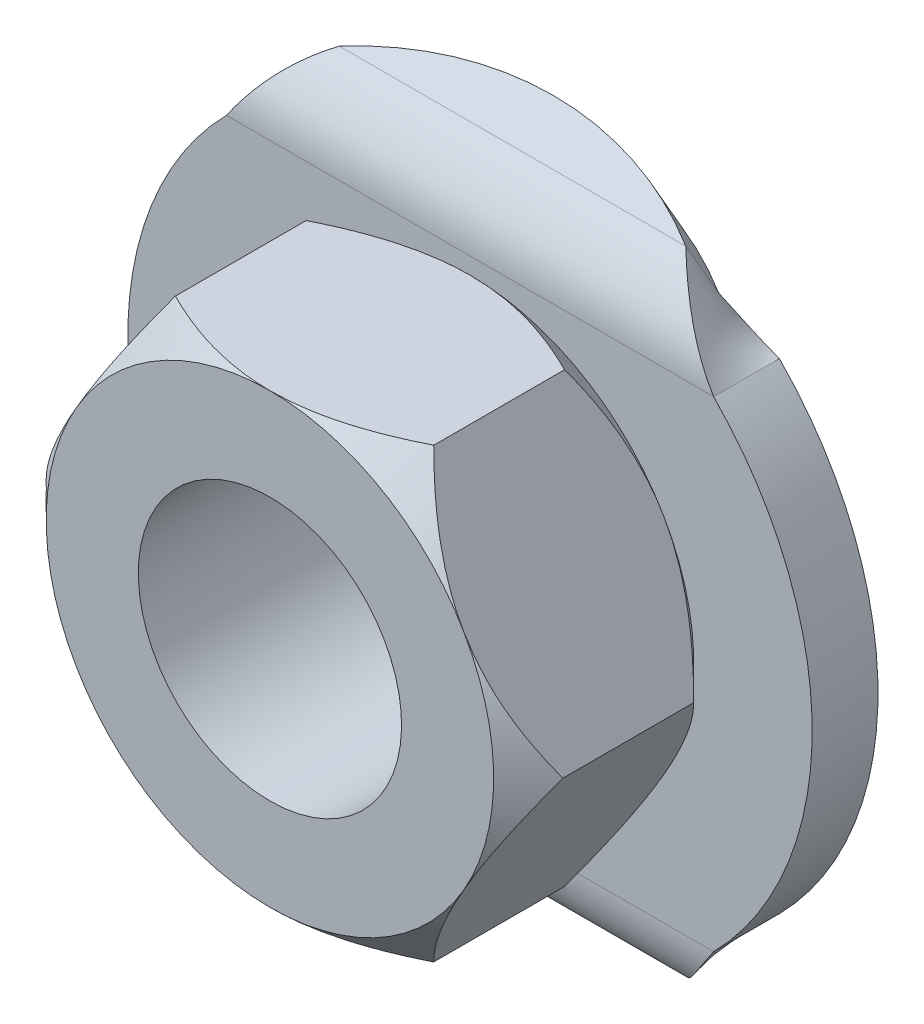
ISO-10303-21;
HEADER;
FILE_DESCRIPTION(('STEP AP214'),'2;1');
FILE_NAME('part.step','',(''),(''),'','','');
FILE_SCHEMA(('AUTOMOTIVE_DESIGN { 1 0 10303 214 1 1 1 1 }'));
ENDSEC;
DATA;
#1=APPLICATION_CONTEXT('core data for automotive mechanical design processes');
#2=APPLICATION_PROTOCOL_DEFINITION('international standard','automotive_design',2000,#1);
#3=PRODUCT_CONTEXT('',#1,'mechanical');
#4=PRODUCT('Part','Part','',(#3));
#5=PRODUCT_RELATED_PRODUCT_CATEGORY('part','',(#4));
#6=PRODUCT_DEFINITION_FORMATION('','',#4);
#7=PRODUCT_DEFINITION_CONTEXT('part definition',#1,'design');
#8=PRODUCT_DEFINITION('design','',#6,#7);
#9=PRODUCT_DEFINITION_SHAPE('','',#8);
#10=(LENGTH_UNIT() NAMED_UNIT(*) SI_UNIT(.MILLI.,.METRE.));
#11=(NAMED_UNIT(*) PLANE_ANGLE_UNIT() SI_UNIT($,.RADIAN.));
#12=(NAMED_UNIT(*) SI_UNIT($,.STERADIAN.) SOLID_ANGLE_UNIT());
#13=UNCERTAINTY_MEASURE_WITH_UNIT(LENGTH_MEASURE(1.E-05),#10,'distance_accuracy_value','');
#14=(GEOMETRIC_REPRESENTATION_CONTEXT(3) GLOBAL_UNCERTAINTY_ASSIGNED_CONTEXT((#13)) GLOBAL_UNIT_ASSIGNED_CONTEXT((#10,
#11,#12)) REPRESENTATION_CONTEXT('',''));
#15=CARTESIAN_POINT('',(0.,0.,0.));
#16=DIRECTION('',(0.,0.,1.));
#17=DIRECTION('',(1.,0.,0.));
#18=AXIS2_PLACEMENT_3D('',#15,#16,#17);
#19=CARTESIAN_POINT('',(0.,0.,2.5));
#20=DIRECTION('',(0.,0.,-1.));
#21=DIRECTION('',(1.,0.,0.));
#22=AXIS2_PLACEMENT_3D('',#19,#20,#21);
#23=PLANE('',#22);
#24=CARTESIAN_POINT('',(0.,0.,2.5));
#25=DIRECTION('',(0.,0.,-1.));
#26=DIRECTION('',(0.,1.,0.));
#27=AXIS2_PLACEMENT_3D('',#24,#25,#26);
#28=CIRCLE('',#27,8.5);
#29=CARTESIAN_POINT('',(-7.36121593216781,4.25,2.5));
#30=VERTEX_POINT('',#29);
#31=CARTESIAN_POINT('',(0.,8.5,2.5));
#32=VERTEX_POINT('',#31);
#33=EDGE_CURVE('E25',#30,#32,#28,.T.);
#34=ORIENTED_EDGE('',*,*,#33,.T.);
#35=CARTESIAN_POINT('',(0.,0.,2.5));
#36=DIRECTION('',(0.,0.,-1.));
#37=DIRECTION('',(0.,1.,0.));
#38=AXIS2_PLACEMENT_3D('',#35,#36,#37);
#39=CIRCLE('',#38,8.5);
#40=CARTESIAN_POINT('',(7.36121593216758,4.25,2.5));
#41=VERTEX_POINT('',#40);
#42=EDGE_CURVE('E9',#32,#41,#39,.T.);
#43=ORIENTED_EDGE('',*,*,#42,.T.);
#44=CARTESIAN_POINT('',(0.,0.,2.5));
#45=DIRECTION('',(0.,0.,-1.));
#46=DIRECTION('',(0.,1.,0.));
#47=AXIS2_PLACEMENT_3D('',#44,#45,#46);
#48=CIRCLE('',#47,8.5);
#49=CARTESIAN_POINT('',(7.36121593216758,-4.25,2.5));
#50=VERTEX_POINT('',#49);
#51=EDGE_CURVE('E401',#41,#50,#48,.T.);
#52=ORIENTED_EDGE('',*,*,#51,.T.);
#53=CARTESIAN_POINT('',(0.,0.,2.5));
#54=DIRECTION('',(0.,0.,-1.));
#55=DIRECTION('',(0.,1.,0.));
#56=AXIS2_PLACEMENT_3D('',#53,#54,#55);
#57=CIRCLE('',#56,8.5);
#58=CARTESIAN_POINT('',(0.,-8.5,2.5));
#59=VERTEX_POINT('',#58);
#60=EDGE_CURVE('E165',#50,#59,#57,.T.);
#61=ORIENTED_EDGE('',*,*,#60,.T.);
#62=CARTESIAN_POINT('',(0.,0.,2.5));
#63=DIRECTION('',(0.,0.,-1.));
#64=DIRECTION('',(0.,1.,0.));
#65=AXIS2_PLACEMENT_3D('',#62,#63,#64);
#66=CIRCLE('',#65,8.5);
#67=CARTESIAN_POINT('',(-7.36121593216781,-4.25,2.5));
#68=VERTEX_POINT('',#67);
#69=EDGE_CURVE('E160',#59,#68,#66,.T.);
#70=ORIENTED_EDGE('',*,*,#69,.T.);
#71=CARTESIAN_POINT('',(0.,0.,2.5));
#72=DIRECTION('',(0.,0.,-1.));
#73=DIRECTION('',(0.,1.,0.));
#74=AXIS2_PLACEMENT_3D('',#71,#72,#73);
#75=CIRCLE('',#74,8.5);
#76=EDGE_CURVE('E163',#68,#30,#75,.T.);
#77=ORIENTED_EDGE('',*,*,#76,.T.);
#78=EDGE_LOOP('',(#34,#43,#52,#61,#70,#77));
#79=FACE_BOUND('',#78,.T.);
#80=CARTESIAN_POINT('',(0.,0.,2.5));
#81=DIRECTION('',(0.,0.,-1.));
#82=DIRECTION('',(1.,0.,0.));
#83=AXIS2_PLACEMENT_3D('',#80,#81,#82);
#84=CIRCLE('',#83,13.);
#85=CARTESIAN_POINT('',(9.2530255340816,9.13134811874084,2.5));
#86=VERTEX_POINT('',#85);
#87=CARTESIAN_POINT('',(9.2530255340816,-9.13134811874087,2.5000000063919));
#88=VERTEX_POINT('',#87);
#89=EDGE_CURVE('E533',#86,#88,#84,.T.);
#90=ORIENTED_EDGE('',*,*,#89,.F.);
#91=DIRECTION('',(-1.,0.,0.));
#92=VECTOR('',#91,1.);
#93=CARTESIAN_POINT('',(0.,9.13134811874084,2.5));
#94=LINE('',#93,#92);
#95=CARTESIAN_POINT('',(-9.25302553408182,9.13134811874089,2.5000000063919));
#96=VERTEX_POINT('',#95);
#97=EDGE_CURVE('E511',#86,#96,#94,.T.);
#98=ORIENTED_EDGE('',*,*,#97,.T.);
#99=CARTESIAN_POINT('',(-9.25302553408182,-9.13134811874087,2.5));
#100=VERTEX_POINT('',#99);
#101=EDGE_CURVE('E530',#100,#96,#84,.T.);
#102=ORIENTED_EDGE('',*,*,#101,.F.);
#103=DIRECTION('',(1.,0.,0.));
#104=VECTOR('',#103,1.);
#105=CARTESIAN_POINT('',(0.,-9.13134811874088,2.5));
#106=LINE('',#105,#104);
#107=EDGE_CURVE('E513',#100,#88,#106,.T.);
#108=ORIENTED_EDGE('',*,*,#107,.T.);
#109=EDGE_LOOP('',(#90,#98,#102,#108));
#110=FACE_BOUND('',#109,.T.);
#111=ADVANCED_FACE('F14',(#79,#110),#23,.F.);
#112=CARTESIAN_POINT('',(0.,0.,0.));
#113=DIRECTION('',(0.,0.,1.));
#114=DIRECTION('',(-1.,0.,0.));
#115=AXIS2_PLACEMENT_3D('',#112,#113,#114);
#116=CYLINDRICAL_SURFACE('',#115,13.);
#117=CARTESIAN_POINT('',(0.,0.,0.));
#118=DIRECTION('',(0.,0.,-1.));
#119=DIRECTION('',(1.,0.,0.));
#120=AXIS2_PLACEMENT_3D('',#117,#118,#119);
#121=CIRCLE('',#120,13.);
#122=CARTESIAN_POINT('',(9.2530255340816,9.13134811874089,6.39190089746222E-09));
#123=VERTEX_POINT('',#122);
#124=CARTESIAN_POINT('',(9.2530255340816,-9.13134811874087,6.39184538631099E-09));
#125=VERTEX_POINT('',#124);
#126=EDGE_CURVE('E532',#123,#125,#121,.T.);
#127=ORIENTED_EDGE('',*,*,#126,.F.);
#128=CARTESIAN_POINT('',(9.2530255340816,9.13134811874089,2.5000000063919));
#129=CARTESIAN_POINT('',(9.2530255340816,9.13134811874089,6.39190089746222E-09));
#130=B_SPLINE_CURVE_WITH_KNOTS('',1,(#128,#129),.UNSPECIFIED.,.F.,.F.,(2,2),(0.,1.),.UNSPECIFIED.);
#131=EDGE_CURVE('E403',#123,#86,#130,.F.);
#132=ORIENTED_EDGE('',*,*,#131,.T.);
#133=ORIENTED_EDGE('',*,*,#89,.T.);
#134=CARTESIAN_POINT('',(9.2530255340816,-9.13134811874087,6.39184538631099E-09));
#135=CARTESIAN_POINT('',(9.2530255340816,-9.13134811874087,2.5000000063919));
#136=B_SPLINE_CURVE_WITH_KNOTS('',1,(#134,#135),.UNSPECIFIED.,.F.,.F.,(2,2),(0.,1.),.UNSPECIFIED.);
#137=EDGE_CURVE('E517',#88,#125,#136,.F.);
#138=ORIENTED_EDGE('',*,*,#137,.T.);
#139=EDGE_LOOP('',(#127,#132,#133,#138));
#140=FACE_BOUND('',#139,.T.);
#141=ADVANCED_FACE('F474',(#140),#116,.T.);
#142=ORIENTED_EDGE('',*,*,#101,.T.);
#143=CARTESIAN_POINT('',(-9.25302553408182,9.13134811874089,6.39190089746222E-09));
#144=CARTESIAN_POINT('',(-9.25302553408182,9.13134811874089,2.5000000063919));
#145=B_SPLINE_CURVE_WITH_KNOTS('',1,(#143,#144),.UNSPECIFIED.,.F.,.F.,(2,2),(0.,1.),.UNSPECIFIED.);
#146=CARTESIAN_POINT('',(-9.25302553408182,9.13134811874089,6.39190089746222E-09));
#147=VERTEX_POINT('',#146);
#148=EDGE_CURVE('E503',#96,#147,#145,.F.);
#149=ORIENTED_EDGE('',*,*,#148,.T.);
#150=CARTESIAN_POINT('',(-9.25302553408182,-9.13134811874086,6.39184538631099E-09));
#151=VERTEX_POINT('',#150);
#152=EDGE_CURVE('E692',#151,#147,#121,.T.);
#153=ORIENTED_EDGE('',*,*,#152,.F.);
#154=CARTESIAN_POINT('',(-9.25302553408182,-9.13134811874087,2.5000000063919));
#155=CARTESIAN_POINT('',(-9.25302553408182,-9.13134811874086,6.39184538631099E-09));
#156=B_SPLINE_CURVE_WITH_KNOTS('',1,(#154,#155),.UNSPECIFIED.,.F.,.F.,(2,2),(0.,1.),.UNSPECIFIED.);
#157=EDGE_CURVE('E504',#151,#100,#156,.F.);
#158=ORIENTED_EDGE('',*,*,#157,.T.);
#159=EDGE_LOOP('',(#142,#149,#153,#158));
#160=FACE_BOUND('',#159,.T.);
#161=ADVANCED_FACE('F464',(#160),#116,.T.);
#162=CARTESIAN_POINT('',(0.,0.,0.));
#163=DIRECTION('',(0.,0.,-1.));
#164=DIRECTION('',(1.,0.,0.));
#165=AXIS2_PLACEMENT_3D('',#162,#163,#164);
#166=PLANE('',#165);
#167=DIRECTION('',(-1.,0.,0.));
#168=VECTOR('',#167,1.);
#169=CARTESIAN_POINT('',(0.,9.13134811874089,0.));
#170=LINE('',#169,#168);
#171=EDGE_CURVE('E497',#123,#147,#170,.T.);
#172=ORIENTED_EDGE('',*,*,#171,.F.);
#173=ORIENTED_EDGE('',*,*,#126,.T.);
#174=DIRECTION('',(1.,0.,0.));
#175=VECTOR('',#174,1.);
#176=CARTESIAN_POINT('',(0.,-9.13134811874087,0.));
#177=LINE('',#176,#175);
#178=EDGE_CURVE('E523',#151,#125,#177,.T.);
#179=ORIENTED_EDGE('',*,*,#178,.F.);
#180=ORIENTED_EDGE('',*,*,#152,.T.);
#181=EDGE_LOOP('',(#172,#173,#179,#180));
#182=FACE_BOUND('',#181,.T.);
#183=CARTESIAN_POINT('',(0.,0.,0.));
#184=DIRECTION('',(0.,0.,-1.));
#185=DIRECTION('',(1.,0.,0.));
#186=AXIS2_PLACEMENT_3D('',#183,#184,#185);
#187=CIRCLE('',#186,5.);
#188=CARTESIAN_POINT('',(5.,0.,0.));
#189=VERTEX_POINT('',#188);
#190=EDGE_CURVE('E526',#189,#189,#187,.T.);
#191=ORIENTED_EDGE('',*,*,#190,.F.);
#192=EDGE_LOOP('',(#191));
#193=FACE_BOUND('',#192,.T.);
#194=ADVANCED_FACE('F473',(#182,#193),#166,.T.);
#195=CARTESIAN_POINT('',(0.,0.,0.));
#196=DIRECTION('',(0.,0.,1.));
#197=DIRECTION('',(-1.,0.,0.));
#198=AXIS2_PLACEMENT_3D('',#195,#196,#197);
#199=CYLINDRICAL_SURFACE('',#198,5.);
#200=ORIENTED_EDGE('',*,*,#190,.T.);
#201=EDGE_LOOP('',(#200));
#202=FACE_BOUND('',#201,.T.);
#203=CARTESIAN_POINT('',(0.,0.,10.1));
#204=DIRECTION('',(0.,0.,-1.));
#205=DIRECTION('',(0.866025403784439,0.5,0.));
#206=AXIS2_PLACEMENT_3D('',#203,#204,#205);
#207=CIRCLE('',#206,5.);
#208=CARTESIAN_POINT('',(4.3301270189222,2.50000000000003,10.1));
#209=VERTEX_POINT('',#208);
#210=EDGE_CURVE('E320',#209,#209,#207,.T.);
#211=ORIENTED_EDGE('',*,*,#210,.F.);
#212=EDGE_LOOP('',(#211));
#213=FACE_BOUND('',#212,.T.);
#214=ADVANCED_FACE('F638',(#202,#213),#199,.F.);
#215=CARTESIAN_POINT('',(-6.58008674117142,-11.9343259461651,0.881700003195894));
#216=CARTESIAN_POINT('',(-7.16531006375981,-11.6108501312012,1.4419765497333));
#217=CARTESIAN_POINT('',(-7.67868307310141,-11.1432640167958,1.86087539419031));
#218=CARTESIAN_POINT('',(-8.56966267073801,-10.144427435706,2.388836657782));
#219=CARTESIAN_POINT('',(-8.94665652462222,-9.61452570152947,2.5000000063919));
#220=CARTESIAN_POINT('',(-9.25302553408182,-9.13134811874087,2.5000000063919));
#221=CARTESIAN_POINT('',(-6.58008674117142,-9.76926243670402,-0.368299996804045));
#222=CARTESIAN_POINT('',(-7.16413083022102,-9.69579269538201,-0.241046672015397));
#223=CARTESIAN_POINT('',(-7.67868307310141,-9.58922900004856,-0.145454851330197));
#224=CARTESIAN_POINT('',(-8.56966267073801,-9.36190927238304,-0.0252990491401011));
#225=CARTESIAN_POINT('',(-8.94606043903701,-9.24152579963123,6.39184538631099E-09));
#226=CARTESIAN_POINT('',(-9.25302553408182,-9.13134811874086,6.39184538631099E-09));
#227=B_SPLINE_SURFACE_WITH_KNOTS('',1,3,((#215,#216,#217,#218,#219,#220),(#221,#222,#223,#224,
#225,#226)),.UNSPECIFIED.,.F.,.F.,.F.,(2,2),(4,2,4),(0.,1.),(0.,0.5,1.),.UNSPECIFIED.);
#228=CARTESIAN_POINT('',(-6.58008674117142,-9.76926243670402,-0.368299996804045));
#229=CARTESIAN_POINT('',(-6.58008674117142,-11.9343259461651,0.881700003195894));
#230=B_SPLINE_CURVE_WITH_KNOTS('',1,(#228,#229),.UNSPECIFIED.,.F.,.F.,(2,2),(0.,1.),.UNSPECIFIED.);
#231=CARTESIAN_POINT('',(-6.58008674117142,-9.76926243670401,-0.368299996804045));
#232=VERTEX_POINT('',#231);
#233=CARTESIAN_POINT('',(-6.58008674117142,-11.9343259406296,0.8817));
#234=VERTEX_POINT('',#233);
#235=EDGE_CURVE('E762',#232,#234,#230,.T.);
#236=CARTESIAN_POINT('',(-6.58008674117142,-11.9343259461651,0.881700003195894));
#237=CARTESIAN_POINT('',(-7.16531006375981,-11.6108501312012,1.4419765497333));
#238=CARTESIAN_POINT('',(-7.67868307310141,-11.1432640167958,1.86087539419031));
#239=CARTESIAN_POINT('',(-8.56966267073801,-10.144427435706,2.388836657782));
#240=CARTESIAN_POINT('',(-8.94665652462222,-9.61452570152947,2.5000000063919));
#241=CARTESIAN_POINT('',(-9.25302553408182,-9.13134811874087,2.5000000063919));
#242=B_SPLINE_CURVE_WITH_KNOTS('',3,(#236,#237,#238,#239,#240,#241),.UNSPECIFIED.,.F.,.F.,(4,2,
4),(0.,0.5,1.),.UNSPECIFIED.);
#243=EDGE_CURVE('E674',#234,#100,#242,.T.);
#244=CARTESIAN_POINT('',(-9.25302553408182,-9.13134811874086,6.39184538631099E-09));
#245=CARTESIAN_POINT('',(-8.94606043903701,-9.24152579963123,6.39184538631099E-09));
#246=CARTESIAN_POINT('',(-8.56966267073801,-9.36190927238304,-0.0252990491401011));
#247=CARTESIAN_POINT('',(-7.67868307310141,-9.58922900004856,-0.145454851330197));
#248=CARTESIAN_POINT('',(-7.16413083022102,-9.69579269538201,-0.241046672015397));
#249=CARTESIAN_POINT('',(-6.58008674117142,-9.76926243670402,-0.368299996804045));
#250=B_SPLINE_CURVE_WITH_KNOTS('',3,(#244,#245,#246,#247,#248,#249),.UNSPECIFIED.,.F.,.F.,(4,2,
4),(0.,0.5,1.),.UNSPECIFIED.);
#251=EDGE_CURVE('E673',#232,#151,#250,.F.);
#252=ORIENTED_EDGE('',*,*,#235,.T.);
#253=ORIENTED_EDGE('',*,*,#243,.T.);
#254=ORIENTED_EDGE('',*,*,#157,.F.);
#255=ORIENTED_EDGE('',*,*,#251,.F.);
#256=EDGE_LOOP('',(#252,#253,#254,#255));
#257=FACE_BOUND('',#256,.T.);
#258=ADVANCED_FACE('F634',(#257),#227,.F.);
#259=CARTESIAN_POINT('',(9.2530255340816,-9.13134811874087,2.5000000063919));
#260=CARTESIAN_POINT('',(9.0093443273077,-9.48779067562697,2.5000000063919));
#261=CARTESIAN_POINT('',(8.77118350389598,-9.8243653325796,2.441020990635));
#262=CARTESIAN_POINT('',(8.30492100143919,-10.4319714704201,2.2443271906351));
#263=CARTESIAN_POINT('',(8.07698292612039,-10.7029565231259,2.10688425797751));
#264=CARTESIAN_POINT('',(7.4087482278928,-11.4061186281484,1.63407567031));
#265=CARTESIAN_POINT('',(6.98262509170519,-11.7263623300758,1.2419035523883));
#266=CARTESIAN_POINT('',(6.58008674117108,-11.9343259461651,0.88170000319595));
#267=CARTESIAN_POINT('',(9.2530255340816,-9.13134811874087,6.39184538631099E-09));
#268=CARTESIAN_POINT('',(9.00948398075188,-9.21242243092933,6.39184538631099E-09));
#269=CARTESIAN_POINT('',(8.77118350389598,-9.28906809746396,-0.0134227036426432));
#270=CARTESIAN_POINT('',(8.30492100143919,-9.4273498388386,-0.058187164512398));
#271=CARTESIAN_POINT('',(8.07698292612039,-9.4890218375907,-0.0894670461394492));
#272=CARTESIAN_POINT('',(7.4087482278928,-9.64905063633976,-0.197070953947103));
#273=CARTESIAN_POINT('',(6.9838884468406,-9.72178459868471,-0.286065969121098));
#274=CARTESIAN_POINT('',(6.58008674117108,-9.76926243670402,-0.368299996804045));
#275=B_SPLINE_SURFACE_WITH_KNOTS('',1,3,((#259,#260,#261,#262,#263,#264,#265,#266),(#267,#268,
#269,#270,#271,#272,#273,#274)),.UNSPECIFIED.,.F.,.F.,.F.,(2,2),(4,2,2,4),(0.,1.),(0.,0.25,0.5,
1.),.UNSPECIFIED.);
#276=CARTESIAN_POINT('',(9.2530255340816,-9.13134811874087,2.5000000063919));
#277=CARTESIAN_POINT('',(9.0093443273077,-9.48779067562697,2.5000000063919));
#278=CARTESIAN_POINT('',(8.77118350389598,-9.8243653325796,2.441020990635));
#279=CARTESIAN_POINT('',(8.30492100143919,-10.4319714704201,2.2443271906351));
#280=CARTESIAN_POINT('',(8.07698292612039,-10.7029565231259,2.10688425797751));
#281=CARTESIAN_POINT('',(7.4087482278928,-11.4061186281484,1.63407567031));
#282=CARTESIAN_POINT('',(6.98262509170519,-11.7263623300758,1.2419035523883));
#283=CARTESIAN_POINT('',(6.58008674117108,-11.9343259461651,0.88170000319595));
#284=B_SPLINE_CURVE_WITH_KNOTS('',3,(#276,#277,#278,#279,#280,#281,#282,#283),.UNSPECIFIED.,.F.,
.F.,(4,2,2,4),(0.,0.25,0.5,1.),.UNSPECIFIED.);
#285=CARTESIAN_POINT('',(6.58008674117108,-11.9343259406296,0.8817));
#286=VERTEX_POINT('',#285);
#287=EDGE_CURVE('E668',#88,#286,#284,.T.);
#288=CARTESIAN_POINT('',(6.58008674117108,-11.9343259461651,0.88170000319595));
#289=CARTESIAN_POINT('',(6.58008674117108,-9.76926243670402,-0.368299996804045));
#290=B_SPLINE_CURVE_WITH_KNOTS('',1,(#288,#289),.UNSPECIFIED.,.F.,.F.,(2,2),(0.,1.),.UNSPECIFIED.);
#291=CARTESIAN_POINT('',(6.58008674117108,-9.7692624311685,-0.368299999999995));
#292=VERTEX_POINT('',#291);
#293=EDGE_CURVE('E550',#286,#292,#290,.T.);
#294=CARTESIAN_POINT('',(6.58008674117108,-9.76926243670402,-0.368299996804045));
#295=CARTESIAN_POINT('',(6.9838884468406,-9.72178459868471,-0.286065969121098));
#296=CARTESIAN_POINT('',(7.4087482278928,-9.64905063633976,-0.197070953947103));
#297=CARTESIAN_POINT('',(8.07698292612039,-9.4890218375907,-0.0894670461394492));
#298=CARTESIAN_POINT('',(8.30492100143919,-9.4273498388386,-0.058187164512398));
#299=CARTESIAN_POINT('',(8.77118350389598,-9.28906809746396,-0.0134227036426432));
#300=CARTESIAN_POINT('',(9.00948398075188,-9.21242243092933,6.39184538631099E-09));
#301=CARTESIAN_POINT('',(9.2530255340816,-9.13134811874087,6.39184538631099E-09));
#302=B_SPLINE_CURVE_WITH_KNOTS('',3,(#294,#295,#296,#297,#298,#299,#300,#301),.UNSPECIFIED.,.F.,
.F.,(4,2,2,4),(0.,0.5,0.75,1.),.UNSPECIFIED.);
#303=EDGE_CURVE('E617',#125,#292,#302,.F.);
#304=ORIENTED_EDGE('',*,*,#287,.T.);
#305=ORIENTED_EDGE('',*,*,#293,.T.);
#306=ORIENTED_EDGE('',*,*,#303,.F.);
#307=ORIENTED_EDGE('',*,*,#137,.F.);
#308=EDGE_LOOP('',(#304,#305,#306,#307));
#309=FACE_BOUND('',#308,.T.);
#310=ADVANCED_FACE('F592',(#309),#275,.F.);
#311=CARTESIAN_POINT('',(18.7896736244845,-9.13134811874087,-0.7366));
#312=DIRECTION('',(-1.,0.,0.));
#313=DIRECTION('',(0.,1.,0.));
#314=AXIS2_PLACEMENT_3D('',#311,#312,#313);
#315=CYLINDRICAL_SURFACE('',#314,0.73660000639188);
#316=ORIENTED_EDGE('',*,*,#178,.T.);
#317=ORIENTED_EDGE('',*,*,#303,.T.);
#318=DIRECTION('',(1.,0.,0.));
#319=VECTOR('',#318,1.);
#320=CARTESIAN_POINT('',(0.,-9.7692624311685,-0.368299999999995));
#321=LINE('',#320,#319);
#322=EDGE_CURVE('E549',#232,#292,#321,.T.);
#323=ORIENTED_EDGE('',*,*,#322,.F.);
#324=ORIENTED_EDGE('',*,*,#251,.T.);
#325=EDGE_LOOP('',(#316,#317,#323,#324));
#326=FACE_BOUND('',#325,.T.);
#327=ADVANCED_FACE('F590',(#326),#315,.F.);
#328=CARTESIAN_POINT('',(18.7896736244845,-9.13134811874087,-0.7366));
#329=DIRECTION('',(-1.,0.,0.));
#330=DIRECTION('',(0.,1.,0.));
#331=AXIS2_PLACEMENT_3D('',#328,#329,#330);
#332=CYLINDRICAL_SURFACE('',#331,3.23660000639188);
#333=ORIENTED_EDGE('',*,*,#107,.F.);
#334=ORIENTED_EDGE('',*,*,#243,.F.);
#335=DIRECTION('',(1.,0.,0.));
#336=VECTOR('',#335,1.);
#337=CARTESIAN_POINT('',(0.,-11.9343259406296,0.8817));
#338=LINE('',#337,#336);
#339=EDGE_CURVE('E566',#234,#286,#338,.T.);
#340=ORIENTED_EDGE('',*,*,#339,.T.);
#341=ORIENTED_EDGE('',*,*,#287,.F.);
#342=EDGE_LOOP('',(#333,#334,#340,#341));
#343=FACE_BOUND('',#342,.T.);
#344=ADVANCED_FACE('F586',(#343),#332,.T.);
#345=CARTESIAN_POINT('',(0.,-4.1634070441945,9.3413263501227));
#346=DIRECTION('',(0.,0.86602540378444,-0.5));
#347=DIRECTION('',(1.,0.,0.));
#348=AXIS2_PLACEMENT_3D('',#345,#346,#347);
#349=PLANE('',#348);
#350=CARTESIAN_POINT('',(0.,-4.1634070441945,9.3413263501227));
#351=DIRECTION('',(0.,0.86602540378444,-0.5));
#352=DIRECTION('',(1.,0.,0.));
#353=AXIS2_PLACEMENT_3D('',#350,#351,#352);
#354=CIRCLE('',#353,13.);
#355=EDGE_CURVE('E546',#292,#232,#354,.T.);
#356=ORIENTED_EDGE('',*,*,#355,.T.);
#357=ORIENTED_EDGE('',*,*,#322,.T.);
#358=EDGE_LOOP('',(#356,#357));
#359=FACE_BOUND('',#358,.T.);
#360=ADVANCED_FACE('F579',(#359),#349,.T.);
#361=CARTESIAN_POINT('',(0.,-4.1634070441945,9.3413263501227));
#362=DIRECTION('',(0.,-0.86602540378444,0.5));
#363=DIRECTION('',(-1.,0.,0.));
#364=AXIS2_PLACEMENT_3D('',#361,#362,#363);
#365=CYLINDRICAL_SURFACE('',#364,13.);
#366=ORIENTED_EDGE('',*,*,#235,.F.);
#367=ORIENTED_EDGE('',*,*,#355,.F.);
#368=ORIENTED_EDGE('',*,*,#293,.F.);
#369=CARTESIAN_POINT('',(0.,-6.3284705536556,10.5913263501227));
#370=DIRECTION('',(0.,0.86602540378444,-0.5));
#371=DIRECTION('',(1.,0.,0.));
#372=AXIS2_PLACEMENT_3D('',#369,#370,#371);
#373=CIRCLE('',#372,13.);
#374=EDGE_CURVE('E554',#286,#234,#373,.T.);
#375=ORIENTED_EDGE('',*,*,#374,.T.);
#376=EDGE_LOOP('',(#366,#367,#368,#375));
#377=FACE_BOUND('',#376,.T.);
#378=ADVANCED_FACE('F568',(#377),#365,.T.);
#379=CARTESIAN_POINT('',(0.,-6.3284705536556,10.5913263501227));
#380=DIRECTION('',(0.,0.86602540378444,-0.5));
#381=DIRECTION('',(1.,0.,0.));
#382=AXIS2_PLACEMENT_3D('',#379,#380,#381);
#383=PLANE('',#382);
#384=ORIENTED_EDGE('',*,*,#339,.F.);
#385=ORIENTED_EDGE('',*,*,#374,.F.);
#386=EDGE_LOOP('',(#384,#385));
#387=FACE_BOUND('',#386,.T.);
#388=ADVANCED_FACE('F578',(#387),#383,.F.);
#389=CARTESIAN_POINT('',(6.58008674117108,11.9343259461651,0.88170000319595));
#390=CARTESIAN_POINT('',(7.16529206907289,11.6108600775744,1.4419593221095));
#391=CARTESIAN_POINT('',(7.67865654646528,11.1432875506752,1.860857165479));
#392=CARTESIAN_POINT('',(8.5696361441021,10.1444557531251,2.3888274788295));
#393=CARTESIAN_POINT('',(8.94663866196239,9.61454555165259,2.5000000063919));
#394=CARTESIAN_POINT('',(9.2530255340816,9.13134811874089,2.5000000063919));
#395=CARTESIAN_POINT('',(6.58008674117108,9.76926243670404,-0.368299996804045));
#396=CARTESIAN_POINT('',(7.16411311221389,9.69579492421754,-0.241050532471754));
#397=CARTESIAN_POINT('',(7.67865654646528,9.58923435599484,-0.145458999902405));
#398=CARTESIAN_POINT('',(8.5696361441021,9.36191571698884,-0.0253011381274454));
#399=CARTESIAN_POINT('',(8.94604272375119,9.24153026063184,6.39190089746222E-09));
#400=CARTESIAN_POINT('',(9.2530255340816,9.13134811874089,6.39190089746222E-09));
#401=B_SPLINE_SURFACE_WITH_KNOTS('',1,3,((#389,#390,#391,#392,#393,#394),(#395,#396,#397,#398,
#399,#400)),.UNSPECIFIED.,.F.,.F.,.F.,(2,2),(4,2,4),(0.,1.),(0.,0.5,1.),.UNSPECIFIED.);
#402=CARTESIAN_POINT('',(6.58008674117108,9.76926243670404,-0.368299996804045));
#403=CARTESIAN_POINT('',(6.58008674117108,11.9343259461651,0.88170000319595));
#404=B_SPLINE_CURVE_WITH_KNOTS('',1,(#402,#403),.UNSPECIFIED.,.F.,.F.,(2,2),(0.,1.),.UNSPECIFIED.);
#405=CARTESIAN_POINT('',(6.58008674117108,9.76926243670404,-0.368299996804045));
#406=VERTEX_POINT('',#405);
#407=CARTESIAN_POINT('',(6.58008674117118,11.9343259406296,0.8817));
#408=VERTEX_POINT('',#407);
#409=EDGE_CURVE('E342',#406,#408,#404,.T.);
#410=CARTESIAN_POINT('',(6.58008674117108,11.9343259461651,0.88170000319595));
#411=CARTESIAN_POINT('',(7.16529206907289,11.6108600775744,1.4419593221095));
#412=CARTESIAN_POINT('',(7.67865654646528,11.1432875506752,1.860857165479));
#413=CARTESIAN_POINT('',(8.5696361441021,10.1444557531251,2.3888274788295));
#414=CARTESIAN_POINT('',(8.94663866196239,9.61454555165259,2.5000000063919));
#415=CARTESIAN_POINT('',(9.2530255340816,9.13134811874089,2.5000000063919));
#416=B_SPLINE_CURVE_WITH_KNOTS('',3,(#410,#411,#412,#413,#414,#415),.UNSPECIFIED.,.F.,.F.,(4,2,
4),(0.,0.5,1.),.UNSPECIFIED.);
#417=EDGE_CURVE('E442',#408,#86,#416,.T.);
#418=CARTESIAN_POINT('',(9.2530255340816,9.13134811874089,6.39190089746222E-09));
#419=CARTESIAN_POINT('',(8.94604272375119,9.24153026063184,6.39190089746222E-09));
#420=CARTESIAN_POINT('',(8.5696361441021,9.36191571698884,-0.0253011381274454));
#421=CARTESIAN_POINT('',(7.67865654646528,9.58923435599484,-0.145458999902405));
#422=CARTESIAN_POINT('',(7.16411311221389,9.69579492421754,-0.241050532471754));
#423=CARTESIAN_POINT('',(6.58008674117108,9.76926243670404,-0.368299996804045));
#424=B_SPLINE_CURVE_WITH_KNOTS('',3,(#418,#419,#420,#421,#422,#423),.UNSPECIFIED.,.F.,.F.,(4,2,
4),(0.,0.5,1.),.UNSPECIFIED.);
#425=EDGE_CURVE('E688',#406,#123,#424,.F.);
#426=ORIENTED_EDGE('',*,*,#409,.T.);
#427=ORIENTED_EDGE('',*,*,#417,.T.);
#428=ORIENTED_EDGE('',*,*,#131,.F.);
#429=ORIENTED_EDGE('',*,*,#425,.F.);
#430=EDGE_LOOP('',(#426,#427,#428,#429));
#431=FACE_BOUND('',#430,.T.);
#432=ADVANCED_FACE('F584',(#431),#401,.F.);
#433=CARTESIAN_POINT('',(-9.25302553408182,9.13134811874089,2.5000000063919));
#434=CARTESIAN_POINT('',(-9.00931845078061,9.48781743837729,2.5000000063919));
#435=CARTESIAN_POINT('',(-8.77113835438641,9.82441153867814,2.4410122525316));
#436=CARTESIAN_POINT('',(-8.30485005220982,10.4320393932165,2.24429898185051));
#437=CARTESIAN_POINT('',(-8.07690552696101,10.7030267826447,2.10684542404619));
#438=CARTESIAN_POINT('',(-7.40867082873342,11.4061772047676,1.634019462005));
#439=CARTESIAN_POINT('',(-6.98257305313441,11.7263892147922,1.2418569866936));
#440=CARTESIAN_POINT('',(-6.58008674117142,11.9343259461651,0.88170000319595));
#441=CARTESIAN_POINT('',(-9.25302553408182,9.13134811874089,6.39190089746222E-09));
#442=CARTESIAN_POINT('',(-9.0094581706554,9.21242850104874,6.39190089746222E-09));
#443=CARTESIAN_POINT('',(-8.77113835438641,9.28907861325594,-0.013424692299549));
#444=CARTESIAN_POINT('',(-8.30485005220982,9.42736529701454,-0.0581935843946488));
#445=CARTESIAN_POINT('',(-8.07690552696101,9.48903782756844,-0.0894758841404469));
#446=CARTESIAN_POINT('',(-7.40867082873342,9.64906396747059,-0.197083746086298));
#447=CARTESIAN_POINT('',(-6.9838368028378,9.72179067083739,-0.28607648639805));
#448=CARTESIAN_POINT('',(-6.58008674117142,9.76926243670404,-0.368299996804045));
#449=B_SPLINE_SURFACE_WITH_KNOTS('',1,3,((#433,#434,#435,#436,#437,#438,#439,#440),(#441,#442,
#443,#444,#445,#446,#447,#448)),.UNSPECIFIED.,.F.,.F.,.F.,(2,2),(4,2,2,4),(0.,1.),(0.,0.25,0.5,
1.),.UNSPECIFIED.);
#450=CARTESIAN_POINT('',(-9.25302553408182,9.13134811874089,2.5000000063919));
#451=CARTESIAN_POINT('',(-9.00931845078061,9.48781743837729,2.5000000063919));
#452=CARTESIAN_POINT('',(-8.77113835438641,9.82441153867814,2.4410122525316));
#453=CARTESIAN_POINT('',(-8.30485005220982,10.4320393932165,2.24429898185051));
#454=CARTESIAN_POINT('',(-8.07690552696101,10.7030267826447,2.10684542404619));
#455=CARTESIAN_POINT('',(-7.40867082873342,11.4061772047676,1.634019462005));
#456=CARTESIAN_POINT('',(-6.98257305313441,11.7263892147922,1.2418569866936));
#457=CARTESIAN_POINT('',(-6.58008674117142,11.9343259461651,0.88170000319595));
#458=B_SPLINE_CURVE_WITH_KNOTS('',3,(#450,#451,#452,#453,#454,#455,#456,#457),.UNSPECIFIED.,.F.,
.F.,(4,2,2,4),(0.,0.25,0.5,1.),.UNSPECIFIED.);
#459=CARTESIAN_POINT('',(-6.58008674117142,11.9343259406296,0.8817));
#460=VERTEX_POINT('',#459);
#461=EDGE_CURVE('E445',#96,#460,#458,.T.);
#462=CARTESIAN_POINT('',(-6.58008674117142,11.9343259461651,0.88170000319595));
#463=CARTESIAN_POINT('',(-6.58008674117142,9.76926243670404,-0.368299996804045));
#464=B_SPLINE_CURVE_WITH_KNOTS('',1,(#462,#463),.UNSPECIFIED.,.F.,.F.,(2,2),(0.,1.),.UNSPECIFIED.);
#465=CARTESIAN_POINT('',(-6.58008674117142,9.76926243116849,-0.368299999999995));
#466=VERTEX_POINT('',#465);
#467=EDGE_CURVE('E439',#460,#466,#464,.T.);
#468=CARTESIAN_POINT('',(-6.58008674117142,9.76926243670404,-0.368299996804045));
#469=CARTESIAN_POINT('',(-6.9838368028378,9.72179067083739,-0.28607648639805));
#470=CARTESIAN_POINT('',(-7.40867082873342,9.64906396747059,-0.197083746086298));
#471=CARTESIAN_POINT('',(-8.07690552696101,9.48903782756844,-0.0894758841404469));
#472=CARTESIAN_POINT('',(-8.30485005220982,9.42736529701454,-0.0581935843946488));
#473=CARTESIAN_POINT('',(-8.77113835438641,9.28907861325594,-0.013424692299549));
#474=CARTESIAN_POINT('',(-9.0094581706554,9.21242850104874,6.39190089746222E-09));
#475=CARTESIAN_POINT('',(-9.25302553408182,9.13134811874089,6.39190089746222E-09));
#476=B_SPLINE_CURVE_WITH_KNOTS('',3,(#468,#469,#470,#471,#472,#473,#474,#475),.UNSPECIFIED.,.F.,
.F.,(4,2,2,4),(0.,0.5,0.75,1.),.UNSPECIFIED.);
#477=EDGE_CURVE('E695',#147,#466,#476,.F.);
#478=ORIENTED_EDGE('',*,*,#461,.T.);
#479=ORIENTED_EDGE('',*,*,#467,.T.);
#480=ORIENTED_EDGE('',*,*,#477,.F.);
#481=ORIENTED_EDGE('',*,*,#148,.F.);
#482=EDGE_LOOP('',(#478,#479,#480,#481));
#483=FACE_BOUND('',#482,.T.);
#484=ADVANCED_FACE('F694',(#483),#449,.F.);
#485=CARTESIAN_POINT('',(-18.7896736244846,9.13134811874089,-0.7366));
#486=DIRECTION('',(1.,0.,0.));
#487=DIRECTION('',(0.,0.,1.));
#488=AXIS2_PLACEMENT_3D('',#485,#486,#487);
#489=CYLINDRICAL_SURFACE('',#488,0.73660000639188);
#490=ORIENTED_EDGE('',*,*,#171,.T.);
#491=ORIENTED_EDGE('',*,*,#477,.T.);
#492=DIRECTION('',(-1.,0.,0.));
#493=VECTOR('',#492,1.);
#494=CARTESIAN_POINT('',(0.,9.76926243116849,-0.368299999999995));
#495=LINE('',#494,#493);
#496=EDGE_CURVE('E443',#406,#466,#495,.T.);
#497=ORIENTED_EDGE('',*,*,#496,.F.);
#498=ORIENTED_EDGE('',*,*,#425,.T.);
#499=EDGE_LOOP('',(#490,#491,#497,#498));
#500=FACE_BOUND('',#499,.T.);
#501=ADVANCED_FACE('F718',(#500),#489,.F.);
#502=CARTESIAN_POINT('',(-18.7896736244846,9.13134811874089,-0.7366));
#503=DIRECTION('',(1.,0.,0.));
#504=DIRECTION('',(0.,0.,1.));
#505=AXIS2_PLACEMENT_3D('',#502,#503,#504);
#506=CYLINDRICAL_SURFACE('',#505,3.23660000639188);
#507=ORIENTED_EDGE('',*,*,#97,.F.);
#508=ORIENTED_EDGE('',*,*,#417,.F.);
#509=DIRECTION('',(-1.,0.,0.));
#510=VECTOR('',#509,1.);
#511=CARTESIAN_POINT('',(0.,11.9343259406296,0.8817));
#512=LINE('',#511,#510);
#513=EDGE_CURVE('E346',#408,#460,#512,.T.);
#514=ORIENTED_EDGE('',*,*,#513,.T.);
#515=ORIENTED_EDGE('',*,*,#461,.F.);
#516=EDGE_LOOP('',(#507,#508,#514,#515));
#517=FACE_BOUND('',#516,.T.);
#518=ADVANCED_FACE('F681',(#517),#506,.T.);
#519=CARTESIAN_POINT('',(0.,4.16340704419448,9.3413263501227));
#520=DIRECTION('',(0.,-0.86602540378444,-0.5));
#521=DIRECTION('',(1.,0.,0.));
#522=AXIS2_PLACEMENT_3D('',#519,#520,#521);
#523=PLANE('',#522);
#524=CARTESIAN_POINT('',(0.,4.16340704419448,9.3413263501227));
#525=DIRECTION('',(0.,-0.86602540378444,-0.5));
#526=DIRECTION('',(1.,0.,0.));
#527=AXIS2_PLACEMENT_3D('',#524,#525,#526);
#528=CIRCLE('',#527,13.);
#529=EDGE_CURVE('E447',#466,#406,#528,.T.);
#530=ORIENTED_EDGE('',*,*,#529,.T.);
#531=ORIENTED_EDGE('',*,*,#496,.T.);
#532=EDGE_LOOP('',(#530,#531));
#533=FACE_BOUND('',#532,.T.);
#534=ADVANCED_FACE('F423',(#533),#523,.T.);
#535=CARTESIAN_POINT('',(0.,4.16340704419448,9.3413263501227));
#536=DIRECTION('',(0.,0.86602540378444,0.5));
#537=DIRECTION('',(-1.,0.,0.));
#538=AXIS2_PLACEMENT_3D('',#535,#536,#537);
#539=CYLINDRICAL_SURFACE('',#538,13.);
#540=ORIENTED_EDGE('',*,*,#409,.F.);
#541=ORIENTED_EDGE('',*,*,#529,.F.);
#542=ORIENTED_EDGE('',*,*,#467,.F.);
#543=CARTESIAN_POINT('',(0.,6.32847055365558,10.5913263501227));
#544=DIRECTION('',(0.,-0.86602540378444,-0.5));
#545=DIRECTION('',(1.,0.,0.));
#546=AXIS2_PLACEMENT_3D('',#543,#544,#545);
#547=CIRCLE('',#546,13.);
#548=EDGE_CURVE('E106',#460,#408,#547,.T.);
#549=ORIENTED_EDGE('',*,*,#548,.T.);
#550=EDGE_LOOP('',(#540,#541,#542,#549));
#551=FACE_BOUND('',#550,.T.);
#552=ADVANCED_FACE('F380',(#551),#539,.T.);
#553=CARTESIAN_POINT('',(0.,6.32847055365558,10.5913263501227));
#554=DIRECTION('',(0.,-0.86602540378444,-0.5));
#555=DIRECTION('',(1.,0.,0.));
#556=AXIS2_PLACEMENT_3D('',#553,#554,#555);
#557=PLANE('',#556);
#558=ORIENTED_EDGE('',*,*,#513,.F.);
#559=ORIENTED_EDGE('',*,*,#548,.F.);
#560=EDGE_LOOP('',(#558,#559));
#561=FACE_BOUND('',#560,.T.);
#562=ADVANCED_FACE('F372',(#561),#557,.F.);
#563=CARTESIAN_POINT('',(0.,0.,10.1));
#564=DIRECTION('',(0.,0.,-1.));
#565=DIRECTION('',(0.866025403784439,0.5,0.));
#566=AXIS2_PLACEMENT_3D('',#563,#564,#565);
#567=CONICAL_SURFACE('',#566,8.5,0.78539816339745);
#568=CARTESIAN_POINT('',(0.,0.,10.1));
#569=DIRECTION('',(0.,0.,-1.));
#570=DIRECTION('',(0.866025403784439,0.5,0.));
#571=AXIS2_PLACEMENT_3D('',#568,#569,#570);
#572=CIRCLE('',#571,8.5);
#573=CARTESIAN_POINT('',(7.36121593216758,4.25,10.1));
#574=VERTEX_POINT('',#573);
#575=CARTESIAN_POINT('',(0.,8.5,10.1));
#576=VERTEX_POINT('',#575);
#577=EDGE_CURVE('E19',#574,#576,#572,.F.);
#578=ORIENTED_EDGE('',*,*,#577,.F.);
#579=CARTESIAN_POINT('',(1.7245117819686,14.0130579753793,4.4812275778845));
#580=CARTESIAN_POINT('',(1.85894144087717,13.7802189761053,4.69585707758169));
#581=CARTESIAN_POINT('',(1.99403363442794,13.5462324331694,4.90885080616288));
#582=CARTESIAN_POINT('',(2.26583347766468,13.075461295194,5.33078857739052));
#583=CARTESIAN_POINT('',(2.40254145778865,12.8386761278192,5.53973176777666));
#584=CARTESIAN_POINT('',(2.67884790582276,12.3600993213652,5.95426112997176));
#585=CARTESIAN_POINT('',(2.81846041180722,12.1182833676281,6.15980998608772));
#586=CARTESIAN_POINT('',(3.09989241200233,11.6308288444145,6.5647486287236));
#587=CARTESIAN_POINT('',(3.24171175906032,11.3851905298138,6.76413882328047));
#588=CARTESIAN_POINT('',(3.53914834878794,10.8700152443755,7.17056568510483));
#589=CARTESIAN_POINT('',(3.69497812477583,10.6001101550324,7.37698322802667));
#590=CARTESIAN_POINT('',(4.01030912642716,10.0539408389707,7.77848742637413));
#591=CARTESIAN_POINT('',(4.16981103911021,9.77767542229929,7.97357193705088));
#592=CARTESIAN_POINT('',(4.49265468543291,9.21849382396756,8.34838318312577));
#593=CARTESIAN_POINT('',(4.65598340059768,8.93560019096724,8.52815442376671));
#594=CARTESIAN_POINT('',(4.98757255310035,8.36127093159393,8.86831250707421));
#595=CARTESIAN_POINT('',(5.15583042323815,8.06983975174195,9.02870922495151));
#596=CARTESIAN_POINT('',(5.47521857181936,7.51664325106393,9.30449570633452));
#597=CARTESIAN_POINT('',(5.62566249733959,7.25606672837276,9.42303308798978));
#598=CARTESIAN_POINT('',(5.93082983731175,6.72750139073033,9.63605479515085));
#599=CARTESIAN_POINT('',(6.08555349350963,6.45951215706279,9.73053775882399));
#600=CARTESIAN_POINT('',(6.39536301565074,5.92290632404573,9.88829293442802));
#601=CARTESIAN_POINT('',(6.55036556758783,5.65443402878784,9.9522077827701));
#602=CARTESIAN_POINT('',(6.86287412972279,5.11315332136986,10.0473289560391));
#603=CARTESIAN_POINT('',(7.02037935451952,4.84034626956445,10.0785453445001));
#604=CARTESIAN_POINT('',(7.32608863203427,4.31084226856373,10.1048452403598));
#605=CARTESIAN_POINT('',(7.47424579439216,4.05422653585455,10.1021045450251));
#606=CARTESIAN_POINT('',(7.76961367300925,3.54263436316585,10.0659388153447));
#607=CARTESIAN_POINT('',(7.91682431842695,3.28765804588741,10.032511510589));
#608=CARTESIAN_POINT('',(8.21176079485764,2.77681308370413,9.93644000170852));
#609=CARTESIAN_POINT('',(8.35944014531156,2.52102494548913,9.87323585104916));
#610=CARTESIAN_POINT('',(8.65143921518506,2.01526772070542,9.72142496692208));
#611=CARTESIAN_POINT('',(8.795758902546,1.7652986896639,9.63281799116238));
#612=CARTESIAN_POINT('',(9.08032482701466,1.27241605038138,9.43483301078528));
#613=CARTESIAN_POINT('',(9.22058055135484,1.02948600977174,9.32550879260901));
#614=CARTESIAN_POINT('',(9.49751341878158,0.549824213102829,9.08988946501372));
#615=CARTESIAN_POINT('',(9.63418899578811,0.313095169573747,8.96358707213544));
#616=CARTESIAN_POINT('',(9.90458116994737,-0.155237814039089,8.69700510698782));
#617=CARTESIAN_POINT('',(10.0382874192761,-0.386823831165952,8.55668389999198));
#618=CARTESIAN_POINT('',(10.3026478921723,-0.844709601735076,8.26513355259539));
#619=CARTESIAN_POINT('',(10.4333025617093,-1.07101012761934,8.11390601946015));
#620=CARTESIAN_POINT('',(10.685556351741,-1.50792650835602,7.8103563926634));
#621=CARTESIAN_POINT('',(10.8072837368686,-1.7187645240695,7.6584583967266));
#622=CARTESIAN_POINT('',(11.0486470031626,-2.13681796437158,7.34813661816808));
#623=CARTESIAN_POINT('',(11.1682827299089,-2.34403312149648,7.18971235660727));
#624=CARTESIAN_POINT('',(11.404787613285,-2.75367159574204,6.86876442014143));
#625=CARTESIAN_POINT('',(11.5216711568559,-2.9561198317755,6.70628299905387));
#626=CARTESIAN_POINT('',(11.7538305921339,-3.35823176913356,6.37691751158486));
#627=CARTESIAN_POINT('',(11.8691069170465,-3.55789622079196,6.21003466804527));
#628=CARTESIAN_POINT('',(11.9837079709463,-3.7563910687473,6.0413483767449));
#629=B_SPLINE_CURVE_WITH_KNOTS('',3,(#579,#580,#581,#582,#583,#584,#585,#586,#587,#588,#589,
#590,#591,#592,#593,#594,#595,#596,#597,#598,#599,#600,#601,#602,#603,#604,#605,#606,#607,#608,
#609,#610,#611,#612,#613,#614,#615,#616,#617,#618,#619,#620,#621,#622,#623,#624,#625,#626,#627,
#628),.UNSPECIFIED.,.F.,.F.,(4,2,2,2,2,2,2,2,2,2,2,2,2,2,2,2,2,2,2,2,2,2,2,2,4),(0.,
1.03208198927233,2.06437882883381,3.10447900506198,4.14451012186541,5.26577260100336,
6.38724658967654,7.50534131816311,8.62286372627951,9.59224194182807,10.5616750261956,
11.5097185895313,12.457470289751,13.3448266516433,14.2322486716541,15.1370685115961,
16.0418969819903,16.9444077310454,17.8473068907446,18.7529721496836,19.6585042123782,
20.5192478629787,21.3800547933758,22.2340638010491,23.0878379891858),.UNSPECIFIED.);
#630=CARTESIAN_POINT('',(4.90747728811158,8.5,8.7850454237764));
#631=VERTEX_POINT('',#630);
#632=EDGE_CURVE('E368',#631,#574,#629,.T.);
#633=ORIENTED_EDGE('',*,*,#632,.F.);
#634=CARTESIAN_POINT('',(-4.90770822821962,8.5,8.7849299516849));
#635=CARTESIAN_POINT('',(-4.73896247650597,8.5,8.869289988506));
#636=CARTESIAN_POINT('',(-4.56889987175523,8.5,8.95107537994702));
#637=CARTESIAN_POINT('',(-4.2259258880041,8.5,9.1086801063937));
#638=CARTESIAN_POINT('',(-4.05301301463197,8.5,9.18449618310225));
#639=CARTESIAN_POINT('',(-3.7033077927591,8.5,9.32966661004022));
#640=CARTESIAN_POINT('',(-3.52649889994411,8.5,9.39898147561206));
#641=CARTESIAN_POINT('',(-3.17001499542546,8.5,9.52963931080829));
#642=CARTESIAN_POINT('',(-2.99034042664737,8.5,9.59098349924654));
#643=CARTESIAN_POINT('',(-2.45264890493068,8.5,9.7596822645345));
#644=CARTESIAN_POINT('',(-2.09033938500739,8.5,9.85410101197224));
#645=CARTESIAN_POINT('',(-1.54099225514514,8.5,9.96330945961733));
#646=CARTESIAN_POINT('',(-1.35707983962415,8.5,9.99429440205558));
#647=CARTESIAN_POINT('',(-0.987691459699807,8.5,10.044762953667));
#648=CARTESIAN_POINT('',(-0.802215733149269,8.5,10.0642482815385));
#649=CARTESIAN_POINT('',(-0.350234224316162,8.5,10.0969183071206));
#650=CARTESIAN_POINT('',(-0.0832421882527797,8.5,10.1037726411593));
#651=CARTESIAN_POINT('',(0.450261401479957,8.5,10.0922659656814));
#652=CARTESIAN_POINT('',(0.716772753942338,8.5,10.0738961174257));
#653=CARTESIAN_POINT('',(1.24728257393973,8.5,10.0130237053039));
#654=CARTESIAN_POINT('',(1.51127789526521,8.5,9.97049415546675));
#655=CARTESIAN_POINT('',(2.03473114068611,8.5,9.86361456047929));
#656=CARTESIAN_POINT('',(2.2941894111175,8.5,9.79926618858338));
#657=CARTESIAN_POINT('',(2.75476553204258,8.5,9.66688449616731));
#658=CARTESIAN_POINT('',(2.95690341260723,8.5,9.6023333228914));
#659=CARTESIAN_POINT('',(3.35755072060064,8.5,9.4628291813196));
#660=CARTESIAN_POINT('',(3.55606003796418,8.5,9.38787589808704));
#661=CARTESIAN_POINT('',(3.94882496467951,8.5,9.22924760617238));
#662=CARTESIAN_POINT('',(4.14309174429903,8.5,9.14560002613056));
#663=CARTESIAN_POINT('',(4.52802818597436,8.5,8.97068124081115));
#664=CARTESIAN_POINT('',(4.71869996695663,8.5,8.87941471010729));
#665=CARTESIAN_POINT('',(4.9077082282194,8.5,8.7849299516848));
#666=B_SPLINE_CURVE_WITH_KNOTS('',3,(#634,#635,#636,#637,#638,#639,#640,#641,#642,#643,#644,
#645,#646,#647,#648,#649,#650,#651,#652,#653,#654,#655,#656,#657,#658,#659,#660,#661,#662,#663,
#664,#665),.UNSPECIFIED.,.F.,.F.,(4,2,2,2,2,2,2,2,2,2,2,2,2,2,2,4),(0.,0.565988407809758,
1.13228364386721,1.7018214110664,2.27127198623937,3.39189520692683,3.95110786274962,
4.51023691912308,5.31023384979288,6.11051117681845,6.91168416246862,7.71279572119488,
8.34908108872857,8.98538572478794,9.61974061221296,10.2537091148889),.UNSPECIFIED.);
#667=EDGE_CURVE('E256',#576,#631,#666,.T.);
#668=ORIENTED_EDGE('',*,*,#667,.F.);
#669=EDGE_LOOP('',(#578,#633,#668));
#670=FACE_BOUND('',#669,.T.);
#671=ADVANCED_FACE('F251',(#670),#567,.T.);
#672=CARTESIAN_POINT('',(0.,0.,10.1));
#673=DIRECTION('',(0.,0.,-1.));
#674=DIRECTION('',(0.866025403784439,0.5,0.));
#675=AXIS2_PLACEMENT_3D('',#672,#673,#674);
#676=CIRCLE('',#675,8.5);
#677=CARTESIAN_POINT('',(7.36121593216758,-4.25,10.1));
#678=VERTEX_POINT('',#677);
#679=EDGE_CURVE('E306',#574,#678,#676,.T.);
#680=ORIENTED_EDGE('',*,*,#679,.T.);
#681=CARTESIAN_POINT('',(9.81507004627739,0.000200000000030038,8.7849299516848));
#682=CARTESIAN_POINT('',(9.73069717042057,-0.145938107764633,8.86928998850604));
#683=CARTESIAN_POINT('',(9.6456658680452,-0.293216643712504,8.95107537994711));
#684=CARTESIAN_POINT('',(9.47417887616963,-0.590240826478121,9.10868010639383));
#685=CARTESIAN_POINT('',(9.38772243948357,-0.739987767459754,9.18449618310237));
#686=CARTESIAN_POINT('',(9.21286982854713,-1.04284137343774,9.32966661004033));
#687=CARTESIAN_POINT('',(9.12446538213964,-1.19596236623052,9.39898147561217));
#688=CARTESIAN_POINT('',(8.94622342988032,-1.50468648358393,9.5296393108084));
#689=CARTESIAN_POINT('',(8.85638614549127,-1.66028922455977,9.59098349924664));
#690=CARTESIAN_POINT('',(8.58754038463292,-2.12594374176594,9.7596822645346));
#691=CARTESIAN_POINT('',(8.40638562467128,-2.43971299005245,9.85410101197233));
#692=CARTESIAN_POINT('',(8.13171205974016,-2.91546156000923,9.96330945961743));
#693=CARTESIAN_POINT('',(8.03975585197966,-3.07473438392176,9.9942944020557));
#694=CARTESIAN_POINT('',(7.85506166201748,-3.39463410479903,10.044762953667));
#695=CARTESIAN_POINT('',(7.76232379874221,-3.55526079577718,10.0642482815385));
#696=CARTESIAN_POINT('',(7.53633304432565,-3.94668826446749,10.0969183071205));
#697=CARTESIAN_POINT('',(7.40283702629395,-4.17791015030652,10.1037726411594));
#698=CARTESIAN_POINT('',(7.13608523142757,-4.63993781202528,10.0922659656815));
#699=CARTESIAN_POINT('',(7.00282955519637,-4.87074341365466,10.0738961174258));
#700=CARTESIAN_POINT('',(6.73757464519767,-5.33017839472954,10.013023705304));
#701=CARTESIAN_POINT('',(6.60557698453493,-5.55880504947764,9.97049415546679));
#702=CARTESIAN_POINT('',(6.34385036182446,-6.01212885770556,9.86361456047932));
#703=CARTESIAN_POINT('',(6.21412122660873,-6.23682631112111,9.79926618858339));
#704=CARTESIAN_POINT('',(5.9838331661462,-6.63569693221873,9.66688449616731));
#705=CARTESIAN_POINT('',(5.88276422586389,-6.81075347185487,9.6023333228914));
#706=CARTESIAN_POINT('',(5.6824405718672,-7.15772421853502,9.46282918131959));
#707=CARTESIAN_POINT('',(5.58318591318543,-7.32963833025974,9.38787589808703));
#708=CARTESIAN_POINT('',(5.38680344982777,-7.66978273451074,9.22924760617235));
#709=CARTESIAN_POINT('',(5.28967006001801,-7.83802270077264,9.14560002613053));
#710=CARTESIAN_POINT('',(5.09720183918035,-8.17138743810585,8.97068124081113));
#711=CARTESIAN_POINT('',(5.0018659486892,-8.33651404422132,8.87941471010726));
#712=CARTESIAN_POINT('',(4.90736181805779,-8.5002,8.7849299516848));
#713=B_SPLINE_CURVE_WITH_KNOTS('',3,(#681,#682,#683,#684,#685,#686,#687,#688,#689,#690,#691,
#692,#693,#694,#695,#696,#697,#698,#699,#700,#701,#702,#703,#704,#705,#706,#707,#708,#709,#710,
#711,#712),.UNSPECIFIED.,.F.,.F.,(4,2,2,2,2,2,2,2,2,2,2,2,2,2,2,4),(0.,0.565988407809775,
1.13228364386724,1.70182141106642,2.27127198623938,3.39189520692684,3.95110786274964,
4.51023691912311,5.31023384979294,6.11051117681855,6.91168416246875,7.71279572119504,
8.34908108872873,8.9853857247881,9.61974061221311,10.2537091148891),.UNSPECIFIED.);
#714=CARTESIAN_POINT('',(9.8149545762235,0.,8.7850454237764));
#715=VERTEX_POINT('',#714);
#716=EDGE_CURVE('E272',#715,#678,#713,.T.);
#717=ORIENTED_EDGE('',*,*,#716,.F.);
#718=EDGE_CURVE('E274',#574,#715,#629,.T.);
#719=ORIENTED_EDGE('',*,*,#718,.F.);
#720=EDGE_LOOP('',(#680,#717,#719));
#721=FACE_BOUND('',#720,.T.);
#722=ADVANCED_FACE('F371',(#721),#567,.T.);
#723=CARTESIAN_POINT('',(0.,-8.5,10.1));
#724=VERTEX_POINT('',#723);
#725=EDGE_CURVE('E332',#724,#678,#572,.F.);
#726=ORIENTED_EDGE('',*,*,#725,.F.);
#727=CARTESIAN_POINT('',(4.9077082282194,-8.5,8.7849299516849));
#728=CARTESIAN_POINT('',(4.73896247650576,-8.5,8.86928998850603));
#729=CARTESIAN_POINT('',(4.56889987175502,-8.5,8.95107537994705));
#730=CARTESIAN_POINT('',(4.2259258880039,-8.5,9.10868010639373));
#731=CARTESIAN_POINT('',(4.05301301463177,-8.5,9.18449618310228));
#732=CARTESIAN_POINT('',(3.7033077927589,-8.5,9.32966661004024));
#733=CARTESIAN_POINT('',(3.5264988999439,-8.5,9.39898147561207));
#734=CARTESIAN_POINT('',(3.17001499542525,-8.5,9.5296393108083));
#735=CARTESIAN_POINT('',(2.99034042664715,-8.5,9.59098349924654));
#736=CARTESIAN_POINT('',(2.45264890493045,-8.5,9.7596822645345));
#737=CARTESIAN_POINT('',(2.09033938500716,-8.5,9.85410101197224));
#738=CARTESIAN_POINT('',(1.54099225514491,-8.5,9.9633094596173));
#739=CARTESIAN_POINT('',(1.35707983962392,-8.5,9.99429440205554));
#740=CARTESIAN_POINT('',(0.987691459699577,-8.5,10.0447629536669));
#741=CARTESIAN_POINT('',(0.802215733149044,-8.5,10.0642482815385));
#742=CARTESIAN_POINT('',(0.350234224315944,-8.5,10.0969183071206));
#743=CARTESIAN_POINT('',(0.0832421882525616,-8.5,10.1037726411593));
#744=CARTESIAN_POINT('',(-0.450261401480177,-8.5,10.0922659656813));
#745=CARTESIAN_POINT('',(-0.716772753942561,-8.5,10.0738961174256));
#746=CARTESIAN_POINT('',(-1.24728257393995,-8.5,10.0130237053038));
#747=CARTESIAN_POINT('',(-1.51127789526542,-8.5,9.97049415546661));
#748=CARTESIAN_POINT('',(-2.03473114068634,-8.5,9.86361456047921));
#749=CARTESIAN_POINT('',(-2.29418941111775,-8.5,9.79926618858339));
#750=CARTESIAN_POINT('',(-2.7547655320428,-8.5,9.6668844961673));
#751=CARTESIAN_POINT('',(-2.95690341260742,-8.5,9.6023333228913));
#752=CARTESIAN_POINT('',(-3.35755072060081,-8.5,9.46282918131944));
#753=CARTESIAN_POINT('',(-3.55606003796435,-8.5,9.38787589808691));
#754=CARTESIAN_POINT('',(-3.94882496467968,-8.5,9.22924760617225));
#755=CARTESIAN_POINT('',(-4.1430917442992,-8.5,9.14560002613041));
#756=CARTESIAN_POINT('',(-4.52802818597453,-8.5,8.97068124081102));
#757=CARTESIAN_POINT('',(-4.71869996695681,-8.5,8.87941471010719));
#758=CARTESIAN_POINT('',(-4.90770822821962,-8.5,8.7849299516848));
#759=B_SPLINE_CURVE_WITH_KNOTS('',3,(#727,#728,#729,#730,#731,#732,#733,#734,#735,#736,#737,
#738,#739,#740,#741,#742,#743,#744,#745,#746,#747,#748,#749,#750,#751,#752,#753,#754,#755,#756,
#757,#758),.UNSPECIFIED.,.F.,.F.,(4,2,2,2,2,2,2,2,2,2,2,2,2,2,2,4),(0.,0.565988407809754,
1.1322836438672,1.7018214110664,2.27127198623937,3.39189520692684,3.95110786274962,
4.51023691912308,5.31023384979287,6.11051117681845,6.91168416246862,7.71279572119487,
8.34908108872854,8.98538572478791,9.61974061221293,10.2537091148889),.UNSPECIFIED.);
#760=CARTESIAN_POINT('',(4.90747728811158,-8.5,8.7850454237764));
#761=VERTEX_POINT('',#760);
#762=EDGE_CURVE('E273',#761,#724,#759,.T.);
#763=ORIENTED_EDGE('',*,*,#762,.F.);
#764=EDGE_CURVE('E266',#678,#761,#713,.T.);
#765=ORIENTED_EDGE('',*,*,#764,.F.);
#766=EDGE_LOOP('',(#726,#763,#765));
#767=FACE_BOUND('',#766,.T.);
#768=ADVANCED_FACE('F363',(#767),#567,.T.);
#769=CARTESIAN_POINT('',(-7.36121593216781,-4.25,10.1));
#770=VERTEX_POINT('',#769);
#771=EDGE_CURVE('E336',#770,#724,#572,.F.);
#772=ORIENTED_EDGE('',*,*,#771,.F.);
#773=CARTESIAN_POINT('',(-12.997920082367,5.5130579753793,4.4812275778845));
#774=CARTESIAN_POINT('',(-12.8634904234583,5.28021897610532,4.6958570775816));
#775=CARTESIAN_POINT('',(-12.7283982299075,5.04623243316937,4.90885080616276));
#776=CARTESIAN_POINT('',(-12.4565983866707,4.57546129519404,5.33078857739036));
#777=CARTESIAN_POINT('',(-12.3198904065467,4.33867612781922,5.53973176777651));
#778=CARTESIAN_POINT('',(-12.0435839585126,3.86009932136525,5.95426112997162));
#779=CARTESIAN_POINT('',(-11.9039714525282,3.61828336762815,6.15980998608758));
#780=CARTESIAN_POINT('',(-11.6225394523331,3.13082884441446,6.56474862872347));
#781=CARTESIAN_POINT('',(-11.4807201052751,2.88519052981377,6.76413882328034));
#782=CARTESIAN_POINT('',(-11.1832835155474,2.3700152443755,7.1705656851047));
#783=CARTESIAN_POINT('',(-11.0274537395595,2.1001101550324,7.37698322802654));
#784=CARTESIAN_POINT('',(-10.7121227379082,1.55394083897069,7.77848742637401));
#785=CARTESIAN_POINT('',(-10.5526208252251,1.27767542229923,7.97357193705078));
#786=CARTESIAN_POINT('',(-10.2297771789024,0.718493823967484,8.34838318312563));
#787=CARTESIAN_POINT('',(-10.0664484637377,0.435600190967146,8.52815442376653));
#788=CARTESIAN_POINT('',(-9.73485931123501,-0.138729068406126,8.86831250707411));
#789=CARTESIAN_POINT('',(-9.56660144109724,-0.430160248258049,9.02870922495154));
#790=CARTESIAN_POINT('',(-9.24721329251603,-0.983356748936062,9.3044957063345));
#791=CARTESIAN_POINT('',(-9.09676936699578,-1.24393327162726,9.42303308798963));
#792=CARTESIAN_POINT('',(-8.79160202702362,-1.77249860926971,9.63605479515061));
#793=CARTESIAN_POINT('',(-8.63687837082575,-2.04048784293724,9.73053775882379));
#794=CARTESIAN_POINT('',(-8.32706884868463,-2.57709367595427,9.8882929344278));
#795=CARTESIAN_POINT('',(-8.17206629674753,-2.84556597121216,9.95220778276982));
#796=CARTESIAN_POINT('',(-7.85955773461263,-3.38684667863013,10.047328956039));
#797=CARTESIAN_POINT('',(-7.70205250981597,-3.65965373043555,10.0785453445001));
#798=CARTESIAN_POINT('',(-7.39634323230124,-4.18915773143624,10.1048452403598));
#799=CARTESIAN_POINT('',(-7.2481860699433,-4.44577346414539,10.102104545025));
#800=CARTESIAN_POINT('',(-6.95281819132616,-4.95736563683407,10.0659388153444));
#801=CARTESIAN_POINT('',(-6.80560754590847,-5.21234195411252,10.0325115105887));
#802=CARTESIAN_POINT('',(-6.51067106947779,-5.72318691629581,9.93644000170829));
#803=CARTESIAN_POINT('',(-6.36299171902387,-5.9789750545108,9.87323585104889));
#804=CARTESIAN_POINT('',(-6.07099264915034,-6.48473227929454,9.72142496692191));
#805=CARTESIAN_POINT('',(-5.92667296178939,-6.7347013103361,9.63281799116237));
#806=CARTESIAN_POINT('',(-5.64210703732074,-7.22758394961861,9.43483301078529));
#807=CARTESIAN_POINT('',(-5.5018513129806,-7.47051399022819,9.32550879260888));
#808=CARTESIAN_POINT('',(-5.22491844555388,-7.95017578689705,9.0898894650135));
#809=CARTESIAN_POINT('',(-5.08824286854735,-8.18690483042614,8.96358707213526));
#810=CARTESIAN_POINT('',(-4.81785069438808,-8.65523781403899,8.69700510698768));
#811=CARTESIAN_POINT('',(-4.68414444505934,-8.88682383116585,8.55668389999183));
#812=CARTESIAN_POINT('',(-4.41978397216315,-9.34470960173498,8.26513355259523));
#813=CARTESIAN_POINT('',(-4.28912930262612,-9.57101012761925,8.11390601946));
#814=CARTESIAN_POINT('',(-4.03687551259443,-10.0079265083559,7.81035639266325));
#815=CARTESIAN_POINT('',(-3.91514812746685,-10.2187645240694,7.65845839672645));
#816=CARTESIAN_POINT('',(-3.67378486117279,-10.6368179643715,7.34813661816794));
#817=CARTESIAN_POINT('',(-3.55414913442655,-10.8440331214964,7.18971235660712));
#818=CARTESIAN_POINT('',(-3.31764425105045,-11.253671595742,6.86876442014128));
#819=CARTESIAN_POINT('',(-3.20076070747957,-11.4561198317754,6.70628299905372));
#820=CARTESIAN_POINT('',(-2.96860127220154,-11.8582317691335,6.37691751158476));
#821=CARTESIAN_POINT('',(-2.85332494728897,-12.0578962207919,6.2100346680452));
#822=CARTESIAN_POINT('',(-2.73872389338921,-12.2563910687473,6.0413483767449));
#823=B_SPLINE_CURVE_WITH_KNOTS('',3,(#773,#774,#775,#776,#777,#778,#779,#780,#781,#782,#783,
#784,#785,#786,#787,#788,#789,#790,#791,#792,#793,#794,#795,#796,#797,#798,#799,#800,#801,#802,
#803,#804,#805,#806,#807,#808,#809,#810,#811,#812,#813,#814,#815,#816,#817,#818,#819,#820,#821,
#822),.UNSPECIFIED.,.F.,.F.,(4,2,2,2,2,2,2,2,2,2,2,2,2,2,2,2,2,2,2,2,2,2,2,2,4),(0.,
1.03208198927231,2.06437882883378,3.10447900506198,4.14451012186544,5.26577260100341,
6.38724658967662,7.50534131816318,8.62286372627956,9.59224194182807,10.5616750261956,
11.5097185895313,12.4574702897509,13.3448266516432,14.232248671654,15.137068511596,
16.0418969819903,16.9444077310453,17.8473068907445,18.7529721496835,19.658504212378,
20.5192478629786,21.3800547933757,22.234063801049,23.0878379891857),.UNSPECIFIED.);
#824=CARTESIAN_POINT('',(-4.90747728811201,-8.5,8.7850454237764));
#825=VERTEX_POINT('',#824);
#826=EDGE_CURVE('E231',#825,#770,#823,.F.);
#827=ORIENTED_EDGE('',*,*,#826,.F.);
#828=EDGE_CURVE('E239',#724,#825,#759,.T.);
#829=ORIENTED_EDGE('',*,*,#828,.F.);
#830=EDGE_LOOP('',(#772,#827,#829));
#831=FACE_BOUND('',#830,.T.);
#832=ADVANCED_FACE('F249',(#831),#567,.T.);
#833=CARTESIAN_POINT('',(-9.81507004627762,-0.000199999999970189,8.7849299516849));
#834=CARTESIAN_POINT('',(-9.73069717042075,0.145938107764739,8.86928998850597));
#835=CARTESIAN_POINT('',(-9.64566586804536,0.293216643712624,8.95107537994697));
#836=CARTESIAN_POINT('',(-9.47417887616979,0.590240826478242,9.10868010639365));
#837=CARTESIAN_POINT('',(-9.38772243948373,0.739987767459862,9.18449618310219));
#838=CARTESIAN_POINT('',(-9.2128698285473,1.04284137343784,9.32966661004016));
#839=CARTESIAN_POINT('',(-9.12446538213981,1.19596236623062,9.398981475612));
#840=CARTESIAN_POINT('',(-8.94622342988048,1.50468648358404,9.52963931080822));
#841=CARTESIAN_POINT('',(-8.85638614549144,1.66028922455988,9.59098349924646));
#842=CARTESIAN_POINT('',(-8.58754038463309,2.12594374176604,9.75968226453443));
#843=CARTESIAN_POINT('',(-8.40638562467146,2.43971299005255,9.85410101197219));
#844=CARTESIAN_POINT('',(-8.13171205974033,2.91546156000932,9.96330945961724));
#845=CARTESIAN_POINT('',(-8.03975585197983,3.07473438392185,9.99429440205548));
#846=CARTESIAN_POINT('',(-7.85506166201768,3.39463410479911,10.0447629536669));
#847=CARTESIAN_POINT('',(-7.76232379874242,3.55526079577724,10.0642482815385));
#848=CARTESIAN_POINT('',(-7.53633304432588,3.94668826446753,10.0969183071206));
#849=CARTESIAN_POINT('',(-7.40283702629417,4.17791015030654,10.1037726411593));
#850=CARTESIAN_POINT('',(-7.13608523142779,4.63993781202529,10.0922659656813));
#851=CARTESIAN_POINT('',(-7.0028295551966,4.87074341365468,10.0738961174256));
#852=CARTESIAN_POINT('',(-6.73757464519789,5.33017839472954,10.0130237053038));
#853=CARTESIAN_POINT('',(-6.60557698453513,5.55880504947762,9.97049415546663));
#854=CARTESIAN_POINT('',(-6.34385036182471,6.01212885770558,9.86361456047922));
#855=CARTESIAN_POINT('',(-6.21412122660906,6.2368263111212,9.79926618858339));
#856=CARTESIAN_POINT('',(-5.98383316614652,6.63569693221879,9.6668844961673));
#857=CARTESIAN_POINT('',(-5.88276422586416,6.81075347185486,9.60233332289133));
#858=CARTESIAN_POINT('',(-5.68244057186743,7.15772421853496,9.46282918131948));
#859=CARTESIAN_POINT('',(-5.58318591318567,7.32963833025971,9.38787589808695));
#860=CARTESIAN_POINT('',(-5.38680344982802,7.66978273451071,9.2292476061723));
#861=CARTESIAN_POINT('',(-5.28967006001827,7.83802270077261,9.14560002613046));
#862=CARTESIAN_POINT('',(-5.09720183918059,8.17138743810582,8.97068124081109));
#863=CARTESIAN_POINT('',(-5.00186594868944,8.33651404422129,8.87941471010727));
#864=CARTESIAN_POINT('',(-4.90736181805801,8.5002,8.7849299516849));
#865=B_SPLINE_CURVE_WITH_KNOTS('',3,(#833,#834,#835,#836,#837,#838,#839,#840,#841,#842,#843,
#844,#845,#846,#847,#848,#849,#850,#851,#852,#853,#854,#855,#856,#857,#858,#859,#860,#861,#862,
#863,#864),.UNSPECIFIED.,.F.,.F.,(4,2,2,2,2,2,2,2,2,2,2,2,2,2,2,4),(0.,0.565988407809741,
1.13228364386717,1.70182141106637,2.27127198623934,3.39189520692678,3.95110786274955,
4.510236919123,5.3102338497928,6.1105111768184,6.9116841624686,7.71279572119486,
8.34908108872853,8.98538572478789,9.61974061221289,10.2537091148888),.UNSPECIFIED.);
#866=CARTESIAN_POINT('',(-7.36121593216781,4.25,10.1));
#867=VERTEX_POINT('',#866);
#868=CARTESIAN_POINT('',(-4.90747728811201,8.5,8.7850454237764));
#869=VERTEX_POINT('',#868);
#870=EDGE_CURVE('E233',#867,#869,#865,.T.);
#871=ORIENTED_EDGE('',*,*,#870,.F.);
#872=EDGE_CURVE('E343',#576,#867,#572,.F.);
#873=ORIENTED_EDGE('',*,*,#872,.F.);
#874=EDGE_CURVE('E325',#869,#576,#666,.T.);
#875=ORIENTED_EDGE('',*,*,#874,.F.);
#876=EDGE_LOOP('',(#871,#873,#875));
#877=FACE_BOUND('',#876,.T.);
#878=ADVANCED_FACE('F245',(#877),#567,.T.);
#879=EDGE_CURVE('E341',#867,#770,#572,.F.);
#880=ORIENTED_EDGE('',*,*,#879,.F.);
#881=CARTESIAN_POINT('',(-9.81495457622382,0.,8.7850454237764));
#882=VERTEX_POINT('',#881);
#883=EDGE_CURVE('E232',#882,#867,#865,.T.);
#884=ORIENTED_EDGE('',*,*,#883,.F.);
#885=EDGE_CURVE('E224',#770,#882,#823,.F.);
#886=ORIENTED_EDGE('',*,*,#885,.F.);
#887=EDGE_LOOP('',(#880,#884,#886));
#888=FACE_BOUND('',#887,.T.);
#889=ADVANCED_FACE('F248',(#888),#567,.T.);
#890=CARTESIAN_POINT('',(-7.36121593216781,4.25,2.5));
#891=DIRECTION('',(0.866025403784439,-0.5,0.));
#892=DIRECTION('',(-0.5,-0.866025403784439,0.));
#893=AXIS2_PLACEMENT_3D('',#890,#891,#892);
#894=PLANE('',#893);
#895=CARTESIAN_POINT('',(-9.81507004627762,-0.000199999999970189,3.81507004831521));
#896=CARTESIAN_POINT('',(-9.73069717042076,0.145938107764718,3.73071001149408));
#897=CARTESIAN_POINT('',(-9.64566586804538,0.293216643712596,3.64892462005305));
#898=CARTESIAN_POINT('',(-9.47417887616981,0.590240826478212,3.49131989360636));
#899=CARTESIAN_POINT('',(-9.38772243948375,0.739987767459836,3.41550381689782));
#900=CARTESIAN_POINT('',(-9.21286982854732,1.04284137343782,3.27033338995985));
#901=CARTESIAN_POINT('',(-9.12446538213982,1.1959623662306,3.20101852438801));
#902=CARTESIAN_POINT('',(-8.94622342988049,1.50468648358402,3.07036068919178));
#903=CARTESIAN_POINT('',(-8.85638614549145,1.66028922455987,3.00901650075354));
#904=CARTESIAN_POINT('',(-8.5875403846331,2.12594374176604,2.84031773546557));
#905=CARTESIAN_POINT('',(-8.40638562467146,2.43971299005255,2.74589898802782));
#906=CARTESIAN_POINT('',(-8.13171205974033,2.91546156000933,2.63669054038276));
#907=CARTESIAN_POINT('',(-8.03975585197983,3.07473438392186,2.60570559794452));
#908=CARTESIAN_POINT('',(-7.85506166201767,3.39463410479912,2.55523704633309));
#909=CARTESIAN_POINT('',(-7.76232379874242,3.55526079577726,2.53575171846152));
#910=CARTESIAN_POINT('',(-7.53633304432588,3.94668826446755,2.50308169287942));
#911=CARTESIAN_POINT('',(-7.40283702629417,4.17791015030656,2.49622735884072));
#912=CARTESIAN_POINT('',(-7.13608523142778,4.6399378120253,2.5077340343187));
#913=CARTESIAN_POINT('',(-7.00282955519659,4.87074341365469,2.52610388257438));
#914=CARTESIAN_POINT('',(-6.73757464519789,5.33017839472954,2.58697629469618));
#915=CARTESIAN_POINT('',(-6.60557698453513,5.55880504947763,2.62950584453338));
#916=CARTESIAN_POINT('',(-6.34385036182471,6.01212885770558,2.73638543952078));
#917=CARTESIAN_POINT('',(-6.21412122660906,6.2368263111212,2.80073381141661));
#918=CARTESIAN_POINT('',(-5.98383316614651,6.63569693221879,2.9331155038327));
#919=CARTESIAN_POINT('',(-5.88276422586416,6.81075347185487,2.99766667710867));
#920=CARTESIAN_POINT('',(-5.68244057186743,7.15772421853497,3.13717081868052));
#921=CARTESIAN_POINT('',(-5.58318591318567,7.32963833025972,3.21212410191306));
#922=CARTESIAN_POINT('',(-5.38680344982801,7.66978273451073,3.37075239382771));
#923=CARTESIAN_POINT('',(-5.28967006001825,7.83802270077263,3.45439997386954));
#924=CARTESIAN_POINT('',(-5.09720183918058,8.17138743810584,3.62931875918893));
#925=CARTESIAN_POINT('',(-5.00186594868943,8.33651404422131,3.72058528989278));
#926=CARTESIAN_POINT('',(-4.90736181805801,8.5002,3.81507004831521));
#927=B_SPLINE_CURVE_WITH_KNOTS('',3,(#895,#896,#897,#898,#899,#900,#901,#902,#903,#904,#905,
#906,#907,#908,#909,#910,#911,#912,#913,#914,#915,#916,#917,#918,#919,#920,#921,#922,#923,#924,
#925,#926),.UNSPECIFIED.,.F.,.F.,(4,2,2,2,2,2,2,2,2,2,2,2,2,2,2,4),(0.,0.565988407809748,
1.13228364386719,1.70182141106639,2.27127198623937,3.39189520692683,3.95110786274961,
4.51023691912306,5.31023384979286,6.11051117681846,6.91168416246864,7.71279572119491,
8.34908108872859,8.98538572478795,9.61974061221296,10.2537091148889),.UNSPECIFIED.);
#928=CARTESIAN_POINT('',(-9.81495457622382,0.,3.8149545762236));
#929=VERTEX_POINT('',#928);
#930=EDGE_CURVE('E176',#929,#30,#927,.T.);
#931=ORIENTED_EDGE('',*,*,#930,.F.);
#932=DIRECTION('',(0.,0.,1.));
#933=VECTOR('',#932,1.);
#934=CARTESIAN_POINT('',(-9.81495457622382,0.,2.5));
#935=LINE('',#934,#933);
#936=EDGE_CURVE('E185',#929,#882,#935,.T.);
#937=ORIENTED_EDGE('',*,*,#936,.T.);
#938=ORIENTED_EDGE('',*,*,#883,.T.);
#939=ORIENTED_EDGE('',*,*,#870,.T.);
#940=DIRECTION('',(0.,0.,1.));
#941=VECTOR('',#940,1.);
#942=CARTESIAN_POINT('',(-4.90747728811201,8.5,2.5));
#943=LINE('',#942,#941);
#944=CARTESIAN_POINT('',(-4.90747728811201,8.5,3.8149545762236));
#945=VERTEX_POINT('',#944);
#946=EDGE_CURVE('E91',#945,#869,#943,.T.);
#947=ORIENTED_EDGE('',*,*,#946,.F.);
#948=EDGE_CURVE('E198',#30,#945,#927,.T.);
#949=ORIENTED_EDGE('',*,*,#948,.F.);
#950=EDGE_LOOP('',(#931,#937,#938,#939,#947,#949));
#951=FACE_BOUND('',#950,.T.);
#952=ADVANCED_FACE('F217',(#951),#894,.F.);
#953=CARTESIAN_POINT('',(-7.36121593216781,-4.25,2.5));
#954=DIRECTION('',(0.866025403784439,0.5,0.));
#955=DIRECTION('',(0.,0.,1.));
#956=AXIS2_PLACEMENT_3D('',#953,#954,#955);
#957=PLANE('',#956);
#958=CARTESIAN_POINT('',(-12.997920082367,5.5130579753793,8.1187724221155));
#959=CARTESIAN_POINT('',(-12.8634904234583,5.28021897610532,7.9041429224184));
#960=CARTESIAN_POINT('',(-12.7283982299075,5.04623243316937,7.69114919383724));
#961=CARTESIAN_POINT('',(-12.4565983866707,4.57546129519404,7.26921142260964));
#962=CARTESIAN_POINT('',(-12.3198904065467,4.33867612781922,7.06026823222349));
#963=CARTESIAN_POINT('',(-12.0435839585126,3.86009932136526,6.64573887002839));
#964=CARTESIAN_POINT('',(-11.9039714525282,3.61828336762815,6.44019001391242));
#965=CARTESIAN_POINT('',(-11.6225394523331,3.13082884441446,6.03525137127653));
#966=CARTESIAN_POINT('',(-11.4807201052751,2.88519052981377,5.83586117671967));
#967=CARTESIAN_POINT('',(-11.1832835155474,2.3700152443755,5.4294343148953));
#968=CARTESIAN_POINT('',(-11.0274537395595,2.1001101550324,5.22301677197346));
#969=CARTESIAN_POINT('',(-10.7121227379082,1.55394083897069,4.82151257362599));
#970=CARTESIAN_POINT('',(-10.5526208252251,1.27767542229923,4.62642806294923));
#971=CARTESIAN_POINT('',(-10.2297771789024,0.718493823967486,4.25161681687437));
#972=CARTESIAN_POINT('',(-10.0664484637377,0.435600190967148,4.07184557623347));
#973=CARTESIAN_POINT('',(-9.73485931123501,-0.138729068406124,3.73168749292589));
#974=CARTESIAN_POINT('',(-9.56660144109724,-0.430160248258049,3.57129077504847));
#975=CARTESIAN_POINT('',(-9.24721329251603,-0.983356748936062,3.2955042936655));
#976=CARTESIAN_POINT('',(-9.09676936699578,-1.24393327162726,3.17696691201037));
#977=CARTESIAN_POINT('',(-8.79160202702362,-1.77249860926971,2.96394520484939));
#978=CARTESIAN_POINT('',(-8.63687837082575,-2.04048784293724,2.86946224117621));
#979=CARTESIAN_POINT('',(-8.32706884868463,-2.57709367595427,2.7117070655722));
#980=CARTESIAN_POINT('',(-8.17206629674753,-2.84556597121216,2.64779221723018));
#981=CARTESIAN_POINT('',(-7.85955773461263,-3.38684667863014,2.55267104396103));
#982=CARTESIAN_POINT('',(-7.70205250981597,-3.65965373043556,2.52145465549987));
#983=CARTESIAN_POINT('',(-7.39634323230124,-4.18915773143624,2.49515475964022));
#984=CARTESIAN_POINT('',(-7.24818606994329,-4.44577346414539,2.49789545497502));
#985=CARTESIAN_POINT('',(-6.95281819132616,-4.95736563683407,2.5340611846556));
#986=CARTESIAN_POINT('',(-6.80560754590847,-5.21234195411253,2.56748848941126));
#987=CARTESIAN_POINT('',(-6.51067106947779,-5.72318691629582,2.6635599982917));
#988=CARTESIAN_POINT('',(-6.36299171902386,-5.97897505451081,2.7267641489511));
#989=CARTESIAN_POINT('',(-6.07099264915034,-6.48473227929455,2.87857503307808));
#990=CARTESIAN_POINT('',(-5.92667296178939,-6.7347013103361,2.96718200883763));
#991=CARTESIAN_POINT('',(-5.64210703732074,-7.22758394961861,3.16516698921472));
#992=CARTESIAN_POINT('',(-5.50185131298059,-7.47051399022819,3.27449120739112));
#993=CARTESIAN_POINT('',(-5.22491844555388,-7.95017578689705,3.5101105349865));
#994=CARTESIAN_POINT('',(-5.08824286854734,-8.18690483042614,3.63641292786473));
#995=CARTESIAN_POINT('',(-4.81785069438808,-8.65523781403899,3.90299489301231));
#996=CARTESIAN_POINT('',(-4.68414444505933,-8.88682383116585,4.04331610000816));
#997=CARTESIAN_POINT('',(-4.41978397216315,-9.34470960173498,4.33486644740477));
#998=CARTESIAN_POINT('',(-4.28912930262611,-9.57101012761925,4.48609398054));
#999=CARTESIAN_POINT('',(-4.03687551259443,-10.0079265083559,4.78964360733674));
#1000=CARTESIAN_POINT('',(-3.91514812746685,-10.2187645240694,4.94154160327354));
#1001=CARTESIAN_POINT('',(-3.67378486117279,-10.6368179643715,5.25186338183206));
#1002=CARTESIAN_POINT('',(-3.55414913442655,-10.8440331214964,5.41028764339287));
#1003=CARTESIAN_POINT('',(-3.31764425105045,-11.253671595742,5.73123557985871));
#1004=CARTESIAN_POINT('',(-3.20076070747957,-11.4561198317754,5.89371700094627));
#1005=CARTESIAN_POINT('',(-2.96860127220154,-11.8582317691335,6.22308248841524));
#1006=CARTESIAN_POINT('',(-2.85332494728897,-12.0578962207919,6.3899653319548));
#1007=CARTESIAN_POINT('',(-2.73872389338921,-12.2563910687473,6.5586516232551));
#1008=B_SPLINE_CURVE_WITH_KNOTS('',3,(#958,#959,#960,#961,#962,#963,#964,#965,#966,#967,#968,
#969,#970,#971,#972,#973,#974,#975,#976,#977,#978,#979,#980,#981,#982,#983,#984,#985,#986,#987,
#988,#989,#990,#991,#992,#993,#994,#995,#996,#997,#998,#999,#1000,#1001,#1002,#1003,#1004,#1005,
#1006,#1007),.UNSPECIFIED.,.F.,.F.,(4,2,2,2,2,2,2,2,2,2,2,2,2,2,2,2,2,2,2,2,2,2,2,2,4),(0.,
1.03208198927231,2.06437882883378,3.10447900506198,4.14451012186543,5.2657726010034,
6.38724658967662,7.50534131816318,8.62286372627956,9.59224194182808,10.5616750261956,
11.5097185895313,12.4574702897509,13.3448266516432,14.232248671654,15.137068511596,
16.0418969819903,16.9444077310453,17.8473068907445,18.7529721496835,19.658504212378,
20.5192478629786,21.3800547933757,22.234063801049,23.0878379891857),.UNSPECIFIED.);
#1009=CARTESIAN_POINT('',(-4.90747728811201,-8.5,3.8149545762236));
#1010=VERTEX_POINT('',#1009);
#1011=EDGE_CURVE('E182',#1010,#68,#1008,.F.);
#1012=ORIENTED_EDGE('',*,*,#1011,.F.);
#1013=DIRECTION('',(0.,0.,1.));
#1014=VECTOR('',#1013,1.);
#1015=CARTESIAN_POINT('',(-4.90747728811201,-8.5,2.5));
#1016=LINE('',#1015,#1014);
#1017=EDGE_CURVE('E322',#1010,#825,#1016,.T.);
#1018=ORIENTED_EDGE('',*,*,#1017,.T.);
#1019=ORIENTED_EDGE('',*,*,#826,.T.);
#1020=ORIENTED_EDGE('',*,*,#885,.T.);
#1021=ORIENTED_EDGE('',*,*,#936,.F.);
#1022=EDGE_CURVE('E174',#68,#929,#1008,.F.);
#1023=ORIENTED_EDGE('',*,*,#1022,.F.);
#1024=EDGE_LOOP('',(#1012,#1018,#1019,#1020,#1021,#1023));
#1025=FACE_BOUND('',#1024,.T.);
#1026=ADVANCED_FACE('F181',(#1025),#957,.F.);
#1027=CARTESIAN_POINT('',(0.,-8.5,2.5));
#1028=DIRECTION('',(0.,1.,0.));
#1029=DIRECTION('',(1.,0.,0.));
#1030=AXIS2_PLACEMENT_3D('',#1027,#1028,#1029);
#1031=PLANE('',#1030);
#1032=CARTESIAN_POINT('',(4.9077082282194,-8.5,3.81507004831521));
#1033=CARTESIAN_POINT('',(4.73896247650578,-8.5,3.73071001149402));
#1034=CARTESIAN_POINT('',(4.56889987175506,-8.5,3.64892462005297));
#1035=CARTESIAN_POINT('',(4.22592588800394,-8.5,3.49131989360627));
#1036=CARTESIAN_POINT('',(4.0530130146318,-8.5,3.41550381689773));
#1037=CARTESIAN_POINT('',(3.70330779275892,-8.5,3.27033338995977));
#1038=CARTESIAN_POINT('',(3.52649889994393,-8.5,3.20101852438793));
#1039=CARTESIAN_POINT('',(3.17001499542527,-8.5,3.0703606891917));
#1040=CARTESIAN_POINT('',(2.99034042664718,-8.5,3.00901650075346));
#1041=CARTESIAN_POINT('',(2.45264890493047,-8.5,2.8403177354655));
#1042=CARTESIAN_POINT('',(2.09033938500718,-8.5,2.74589898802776));
#1043=CARTESIAN_POINT('',(1.54099225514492,-8.5,2.6366905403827));
#1044=CARTESIAN_POINT('',(1.35707983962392,-8.5,2.60570559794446));
#1045=CARTESIAN_POINT('',(0.98769145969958,-8.5,2.55523704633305));
#1046=CARTESIAN_POINT('',(0.802215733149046,-8.5,2.53575171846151));
#1047=CARTESIAN_POINT('',(0.350234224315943,-8.5,2.50308169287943));
#1048=CARTESIAN_POINT('',(0.0832421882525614,-8.5,2.49622735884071));
#1049=CARTESIAN_POINT('',(-0.450261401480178,-8.5,2.50773403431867));
#1050=CARTESIAN_POINT('',(-0.716772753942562,-8.5,2.52610388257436));
#1051=CARTESIAN_POINT('',(-1.24728257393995,-8.5,2.58697629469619));
#1052=CARTESIAN_POINT('',(-1.51127789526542,-8.5,2.62950584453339));
#1053=CARTESIAN_POINT('',(-2.03473114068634,-8.5,2.73638543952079));
#1054=CARTESIAN_POINT('',(-2.29418941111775,-8.5,2.80073381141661));
#1055=CARTESIAN_POINT('',(-2.75476553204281,-8.5,2.9331155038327));
#1056=CARTESIAN_POINT('',(-2.95690341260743,-8.5,2.99766667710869));
#1057=CARTESIAN_POINT('',(-3.35755072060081,-8.5,3.13717081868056));
#1058=CARTESIAN_POINT('',(-3.55606003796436,-8.5,3.21212410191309));
#1059=CARTESIAN_POINT('',(-3.94882496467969,-8.5,3.37075239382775));
#1060=CARTESIAN_POINT('',(-4.14309174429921,-8.5,3.45439997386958));
#1061=CARTESIAN_POINT('',(-4.52802818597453,-8.5,3.62931875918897));
#1062=CARTESIAN_POINT('',(-4.71869996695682,-8.5,3.72058528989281));
#1063=CARTESIAN_POINT('',(-4.90770822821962,-8.5,3.81507004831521));
#1064=B_SPLINE_CURVE_WITH_KNOTS('',3,(#1032,#1033,#1034,#1035,#1036,#1037,#1038,#1039,#1040,
#1041,#1042,#1043,#1044,#1045,#1046,#1047,#1048,#1049,#1050,#1051,#1052,#1053,#1054,#1055,#1056,
#1057,#1058,#1059,#1060,#1061,#1062,#1063),.UNSPECIFIED.,.F.,.F.,(4,2,2,2,2,2,2,2,2,2,2,2,2,2,2,
4),(0.,0.565988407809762,1.13228364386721,1.70182141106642,2.2712719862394,3.39189520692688,
3.95110786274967,4.51023691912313,5.31023384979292,6.1105111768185,6.91168416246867,
7.71279572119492,8.3490810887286,8.98538572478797,9.61974061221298,10.2537091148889),.UNSPECIFIED.);
#1065=CARTESIAN_POINT('',(4.90747728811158,-8.5,3.8149545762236));
#1066=VERTEX_POINT('',#1065);
#1067=EDGE_CURVE('E189',#1066,#59,#1064,.T.);
#1068=ORIENTED_EDGE('',*,*,#1067,.F.);
#1069=DIRECTION('',(0.,0.,1.));
#1070=VECTOR('',#1069,1.);
#1071=CARTESIAN_POINT('',(4.90747728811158,-8.5,2.5));
#1072=LINE('',#1071,#1070);
#1073=EDGE_CURVE('E328',#1066,#761,#1072,.T.);
#1074=ORIENTED_EDGE('',*,*,#1073,.T.);
#1075=ORIENTED_EDGE('',*,*,#762,.T.);
#1076=ORIENTED_EDGE('',*,*,#828,.T.);
#1077=ORIENTED_EDGE('',*,*,#1017,.F.);
#1078=EDGE_CURVE('E188',#59,#1010,#1064,.T.);
#1079=ORIENTED_EDGE('',*,*,#1078,.F.);
#1080=EDGE_LOOP('',(#1068,#1074,#1075,#1076,#1077,#1079));
#1081=FACE_BOUND('',#1080,.T.);
#1082=ADVANCED_FACE('F216',(#1081),#1031,.F.);
#1083=CARTESIAN_POINT('',(7.36121593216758,-4.25,2.5));
#1084=DIRECTION('',(-0.866025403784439,0.5,0.));
#1085=DIRECTION('',(0.5,0.866025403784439,0.));
#1086=AXIS2_PLACEMENT_3D('',#1083,#1084,#1085);
#1087=PLANE('',#1086);
#1088=CARTESIAN_POINT('',(9.81507004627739,0.000200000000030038,3.81507004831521));
#1089=CARTESIAN_POINT('',(9.73069717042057,-0.145938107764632,3.73071001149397));
#1090=CARTESIAN_POINT('',(9.6456658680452,-0.293216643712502,3.64892462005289));
#1091=CARTESIAN_POINT('',(9.47417887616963,-0.59024082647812,3.49131989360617));
#1092=CARTESIAN_POINT('',(9.38772243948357,-0.739987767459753,3.41550381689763));
#1093=CARTESIAN_POINT('',(9.21286982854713,-1.04284137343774,3.27033338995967));
#1094=CARTESIAN_POINT('',(9.12446538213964,-1.19596236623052,3.20101852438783));
#1095=CARTESIAN_POINT('',(8.94622342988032,-1.50468648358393,3.0703606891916));
#1096=CARTESIAN_POINT('',(8.85638614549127,-1.66028922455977,3.00901650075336));
#1097=CARTESIAN_POINT('',(8.58754038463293,-2.12594374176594,2.8403177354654));
#1098=CARTESIAN_POINT('',(8.40638562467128,-2.43971299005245,2.74589898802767));
#1099=CARTESIAN_POINT('',(8.13171205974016,-2.91546156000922,2.63669054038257));
#1100=CARTESIAN_POINT('',(8.03975585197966,-3.07473438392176,2.6057055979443));
#1101=CARTESIAN_POINT('',(7.85506166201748,-3.39463410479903,2.55523704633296));
#1102=CARTESIAN_POINT('',(7.76232379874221,-3.55526079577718,2.5357517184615));
#1103=CARTESIAN_POINT('',(7.53633304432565,-3.94668826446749,2.50308169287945));
#1104=CARTESIAN_POINT('',(7.40283702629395,-4.17791015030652,2.4962273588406));
#1105=CARTESIAN_POINT('',(7.13608523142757,-4.63993781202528,2.50773403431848));
#1106=CARTESIAN_POINT('',(7.00282955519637,-4.87074341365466,2.52610388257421));
#1107=CARTESIAN_POINT('',(6.73757464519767,-5.33017839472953,2.58697629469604));
#1108=CARTESIAN_POINT('',(6.60557698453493,-5.55880504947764,2.62950584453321));
#1109=CARTESIAN_POINT('',(6.34385036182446,-6.01212885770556,2.73638543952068));
#1110=CARTESIAN_POINT('',(6.21412122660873,-6.23682631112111,2.80073381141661));
#1111=CARTESIAN_POINT('',(5.9838331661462,-6.63569693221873,2.93311550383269));
#1112=CARTESIAN_POINT('',(5.88276422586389,-6.81075347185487,2.9976666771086));
#1113=CARTESIAN_POINT('',(5.6824405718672,-7.15772421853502,3.13717081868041));
#1114=CARTESIAN_POINT('',(5.58318591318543,-7.32963833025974,3.21212410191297));
#1115=CARTESIAN_POINT('',(5.38680344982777,-7.66978273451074,3.37075239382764));
#1116=CARTESIAN_POINT('',(5.28967006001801,-7.83802270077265,3.45439997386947));
#1117=CARTESIAN_POINT('',(5.09720183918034,-8.17138743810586,3.62931875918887));
#1118=CARTESIAN_POINT('',(5.0018659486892,-8.33651404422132,3.72058528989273));
#1119=CARTESIAN_POINT('',(4.90736181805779,-8.5002,3.81507004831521));
#1120=B_SPLINE_CURVE_WITH_KNOTS('',3,(#1088,#1089,#1090,#1091,#1092,#1093,#1094,#1095,#1096,
#1097,#1098,#1099,#1100,#1101,#1102,#1103,#1104,#1105,#1106,#1107,#1108,#1109,#1110,#1111,#1112,
#1113,#1114,#1115,#1116,#1117,#1118,#1119),.UNSPECIFIED.,.F.,.F.,(4,2,2,2,2,2,2,2,2,2,2,2,2,2,2,
4),(0.,0.565988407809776,1.13228364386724,1.70182141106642,2.27127198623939,3.39189520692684,
3.95110786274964,4.51023691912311,5.31023384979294,6.11051117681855,6.91168416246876,
7.71279572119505,8.34908108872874,8.9853857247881,9.61974061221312,10.2537091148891),.UNSPECIFIED.);
#1121=CARTESIAN_POINT('',(9.8149545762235,0.,3.81495457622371));
#1122=VERTEX_POINT('',#1121);
#1123=EDGE_CURVE('E292',#1122,#50,#1120,.T.);
#1124=ORIENTED_EDGE('',*,*,#1123,.F.);
#1125=DIRECTION('',(0.,0.,1.));
#1126=VECTOR('',#1125,1.);
#1127=CARTESIAN_POINT('',(9.8149545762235,0.,2.5));
#1128=LINE('',#1127,#1126);
#1129=EDGE_CURVE('E330',#1122,#715,#1128,.T.);
#1130=ORIENTED_EDGE('',*,*,#1129,.T.);
#1131=ORIENTED_EDGE('',*,*,#716,.T.);
#1132=ORIENTED_EDGE('',*,*,#764,.T.);
#1133=ORIENTED_EDGE('',*,*,#1073,.F.);
#1134=EDGE_CURVE('E286',#50,#1066,#1120,.T.);
#1135=ORIENTED_EDGE('',*,*,#1134,.F.);
#1136=EDGE_LOOP('',(#1124,#1130,#1131,#1132,#1133,#1135));
#1137=FACE_BOUND('',#1136,.T.);
#1138=ADVANCED_FACE('F279',(#1137),#1087,.F.);
#1139=CARTESIAN_POINT('',(7.36121593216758,4.25,2.5));
#1140=DIRECTION('',(-0.866025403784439,-0.5,0.));
#1141=DIRECTION('',(-0.5,0.866025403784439,0.));
#1142=AXIS2_PLACEMENT_3D('',#1139,#1140,#1141);
#1143=PLANE('',#1142);
#1144=CARTESIAN_POINT('',(1.7245117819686,14.0130579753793,8.1187724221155));
#1145=CARTESIAN_POINT('',(1.85894144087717,13.7802189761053,7.90414292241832));
#1146=CARTESIAN_POINT('',(1.99403363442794,13.5462324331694,7.69114919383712));
#1147=CARTESIAN_POINT('',(2.26583347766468,13.075461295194,7.26921142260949));
#1148=CARTESIAN_POINT('',(2.40254145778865,12.8386761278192,7.06026823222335));
#1149=CARTESIAN_POINT('',(2.67884790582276,12.3600993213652,6.64573887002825));
#1150=CARTESIAN_POINT('',(2.81846041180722,12.1182833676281,6.44019001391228));
#1151=CARTESIAN_POINT('',(3.09989241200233,11.6308288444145,6.0352513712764));
#1152=CARTESIAN_POINT('',(3.24171175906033,11.3851905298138,5.83586117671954));
#1153=CARTESIAN_POINT('',(3.53914834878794,10.8700152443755,5.42943431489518));
#1154=CARTESIAN_POINT('',(3.69497812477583,10.6001101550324,5.22301677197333));
#1155=CARTESIAN_POINT('',(4.01030912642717,10.0539408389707,4.82151257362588));
#1156=CARTESIAN_POINT('',(4.16981103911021,9.77767542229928,4.62642806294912));
#1157=CARTESIAN_POINT('',(4.49265468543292,9.21849382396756,4.25161681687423));
#1158=CARTESIAN_POINT('',(4.65598340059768,8.93560019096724,4.07184557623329));
#1159=CARTESIAN_POINT('',(4.98757255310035,8.36127093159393,3.73168749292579));
#1160=CARTESIAN_POINT('',(5.15583042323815,8.06983975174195,3.57129077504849));
#1161=CARTESIAN_POINT('',(5.47521857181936,7.51664325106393,3.29550429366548));
#1162=CARTESIAN_POINT('',(5.62566249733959,7.25606672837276,3.17696691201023));
#1163=CARTESIAN_POINT('',(5.93082983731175,6.72750139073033,2.96394520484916));
#1164=CARTESIAN_POINT('',(6.08555349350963,6.45951215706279,2.86946224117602));
#1165=CARTESIAN_POINT('',(6.39536301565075,5.92290632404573,2.71170706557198));
#1166=CARTESIAN_POINT('',(6.55036556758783,5.65443402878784,2.6477922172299));
#1167=CARTESIAN_POINT('',(6.86287412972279,5.11315332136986,2.55267104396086));
#1168=CARTESIAN_POINT('',(7.02037935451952,4.84034626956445,2.52145465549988));
#1169=CARTESIAN_POINT('',(7.32608863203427,4.31084226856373,2.49515475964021));
#1170=CARTESIAN_POINT('',(7.47424579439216,4.05422653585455,2.49789545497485));
#1171=CARTESIAN_POINT('',(7.76961367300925,3.54263436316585,2.53406118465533));
#1172=CARTESIAN_POINT('',(7.91682431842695,3.28765804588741,2.56748848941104));
#1173=CARTESIAN_POINT('',(8.21176079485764,2.77681308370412,2.66355999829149));
#1174=CARTESIAN_POINT('',(8.35944014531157,2.52102494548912,2.72676414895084));
#1175=CARTESIAN_POINT('',(8.65143921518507,2.01526772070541,2.87857503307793));
#1176=CARTESIAN_POINT('',(8.795758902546,1.76529868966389,2.96718200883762));
#1177=CARTESIAN_POINT('',(9.08032482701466,1.27241605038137,3.16516698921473));
#1178=CARTESIAN_POINT('',(9.22058055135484,1.02948600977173,3.27449120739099));
#1179=CARTESIAN_POINT('',(9.49751341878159,0.549824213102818,3.51011053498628));
#1180=CARTESIAN_POINT('',(9.63418899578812,0.313095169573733,3.63641292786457));
#1181=CARTESIAN_POINT('',(9.90458116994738,-0.155237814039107,3.90299489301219));
#1182=CARTESIAN_POINT('',(10.0382874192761,-0.386823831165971,4.04331610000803));
#1183=CARTESIAN_POINT('',(10.3026478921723,-0.844709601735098,4.33486644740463));
#1184=CARTESIAN_POINT('',(10.4333025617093,-1.07101012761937,4.48609398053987));
#1185=CARTESIAN_POINT('',(10.685556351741,-1.50792650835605,4.78964360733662));
#1186=CARTESIAN_POINT('',(10.8072837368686,-1.71876452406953,4.94154160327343));
#1187=CARTESIAN_POINT('',(11.0486470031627,-2.13681796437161,5.25186338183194));
#1188=CARTESIAN_POINT('',(11.1682827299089,-2.34403312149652,5.41028764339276));
#1189=CARTESIAN_POINT('',(11.404787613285,-2.75367159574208,5.7312355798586));
#1190=CARTESIAN_POINT('',(11.5216711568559,-2.95611983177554,5.89371700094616));
#1191=CARTESIAN_POINT('',(11.7538305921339,-3.3582317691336,6.22308248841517));
#1192=CARTESIAN_POINT('',(11.8691069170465,-3.55789622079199,6.38996533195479));
#1193=CARTESIAN_POINT('',(11.9837079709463,-3.7563910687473,6.5586516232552));
#1194=B_SPLINE_CURVE_WITH_KNOTS('',3,(#1144,#1145,#1146,#1147,#1148,#1149,#1150,#1151,#1152,
#1153,#1154,#1155,#1156,#1157,#1158,#1159,#1160,#1161,#1162,#1163,#1164,#1165,#1166,#1167,#1168,
#1169,#1170,#1171,#1172,#1173,#1174,#1175,#1176,#1177,#1178,#1179,#1180,#1181,#1182,#1183,#1184,
#1185,#1186,#1187,#1188,#1189,#1190,#1191,#1192,#1193),.UNSPECIFIED.,.F.,.F.,(4,2,2,2,2,2,2,2,2,
2,2,2,2,2,2,2,2,2,2,2,2,2,2,2,4),(0.,1.03208198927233,2.06437882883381,3.10447900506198,
4.14451012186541,5.26577260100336,6.38724658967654,7.50534131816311,8.6228637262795,
9.59224194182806,10.5616750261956,11.5097185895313,12.457470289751,13.3448266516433,
14.2322486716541,15.1370685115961,16.0418969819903,16.9444077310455,17.8473068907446,
18.7529721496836,19.6585042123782,20.5192478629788,21.3800547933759,22.2340638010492,
23.0878379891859),.UNSPECIFIED.);
#1195=CARTESIAN_POINT('',(4.90747728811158,8.5,3.81495457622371));
#1196=VERTEX_POINT('',#1195);
#1197=EDGE_CURVE('E299',#1196,#41,#1194,.T.);
#1198=ORIENTED_EDGE('',*,*,#1197,.F.);
#1199=DIRECTION('',(0.,0.,1.));
#1200=VECTOR('',#1199,1.);
#1201=CARTESIAN_POINT('',(4.90747728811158,8.5,2.5));
#1202=LINE('',#1201,#1200);
#1203=EDGE_CURVE('E331',#1196,#631,#1202,.T.);
#1204=ORIENTED_EDGE('',*,*,#1203,.T.);
#1205=ORIENTED_EDGE('',*,*,#632,.T.);
#1206=ORIENTED_EDGE('',*,*,#718,.T.);
#1207=ORIENTED_EDGE('',*,*,#1129,.F.);
#1208=EDGE_CURVE('E293',#41,#1122,#1194,.T.);
#1209=ORIENTED_EDGE('',*,*,#1208,.F.);
#1210=EDGE_LOOP('',(#1198,#1204,#1205,#1206,#1207,#1209));
#1211=FACE_BOUND('',#1210,.T.);
#1212=ADVANCED_FACE('F282',(#1211),#1143,.F.);
#1213=CARTESIAN_POINT('',(0.,0.,2.5));
#1214=DIRECTION('',(0.,0.,1.));
#1215=DIRECTION('',(0.866025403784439,0.5,0.));
#1216=AXIS2_PLACEMENT_3D('',#1213,#1214,#1215);
#1217=CONICAL_SURFACE('',#1216,8.5,0.78539816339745);
#1218=ORIENTED_EDGE('',*,*,#1208,.T.);
#1219=ORIENTED_EDGE('',*,*,#1123,.T.);
#1220=ORIENTED_EDGE('',*,*,#51,.F.);
#1221=EDGE_LOOP('',(#1218,#1219,#1220));
#1222=FACE_BOUND('',#1221,.T.);
#1223=ADVANCED_FACE('F385',(#1222),#1217,.T.);
#1224=ORIENTED_EDGE('',*,*,#1134,.T.);
#1225=ORIENTED_EDGE('',*,*,#1067,.T.);
#1226=ORIENTED_EDGE('',*,*,#60,.F.);
#1227=EDGE_LOOP('',(#1224,#1225,#1226));
#1228=FACE_BOUND('',#1227,.T.);
#1229=ADVANCED_FACE('F397',(#1228),#1217,.T.);
#1230=ORIENTED_EDGE('',*,*,#1078,.T.);
#1231=ORIENTED_EDGE('',*,*,#1011,.T.);
#1232=ORIENTED_EDGE('',*,*,#69,.F.);
#1233=EDGE_LOOP('',(#1230,#1231,#1232));
#1234=FACE_BOUND('',#1233,.T.);
#1235=ADVANCED_FACE('F187',(#1234),#1217,.T.);
#1236=ORIENTED_EDGE('',*,*,#1022,.T.);
#1237=ORIENTED_EDGE('',*,*,#930,.T.);
#1238=ORIENTED_EDGE('',*,*,#76,.F.);
#1239=EDGE_LOOP('',(#1236,#1237,#1238));
#1240=FACE_BOUND('',#1239,.T.);
#1241=ADVANCED_FACE('F173',(#1240),#1217,.T.);
#1242=CARTESIAN_POINT('',(0.,8.5,2.5));
#1243=DIRECTION('',(0.,-1.,0.));
#1244=DIRECTION('',(-1.,0.,0.));
#1245=AXIS2_PLACEMENT_3D('',#1242,#1243,#1244);
#1246=PLANE('',#1245);
#1247=CARTESIAN_POINT('',(-4.90770822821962,8.5,3.81507004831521));
#1248=CARTESIAN_POINT('',(-4.73896247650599,8.5,3.73071001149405));
#1249=CARTESIAN_POINT('',(-4.56889987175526,8.5,3.64892462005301));
#1250=CARTESIAN_POINT('',(-4.22592588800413,8.5,3.49131989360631));
#1251=CARTESIAN_POINT('',(-4.053013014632,8.5,3.41550381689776));
#1252=CARTESIAN_POINT('',(-3.70330779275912,8.5,3.27033338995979));
#1253=CARTESIAN_POINT('',(-3.52649889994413,8.5,3.20101852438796));
#1254=CARTESIAN_POINT('',(-3.17001499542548,8.5,3.07036068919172));
#1255=CARTESIAN_POINT('',(-2.99034042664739,8.5,3.00901650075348));
#1256=CARTESIAN_POINT('',(-2.45264890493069,8.5,2.84031773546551));
#1257=CARTESIAN_POINT('',(-2.0903393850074,8.5,2.74589898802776));
#1258=CARTESIAN_POINT('',(-1.54099225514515,8.5,2.63669054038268));
#1259=CARTESIAN_POINT('',(-1.35707983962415,8.5,2.60570559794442));
#1260=CARTESIAN_POINT('',(-0.987691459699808,8.5,2.55523704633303));
#1261=CARTESIAN_POINT('',(-0.80221573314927,8.5,2.53575171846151));
#1262=CARTESIAN_POINT('',(-0.350234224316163,8.5,2.50308169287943));
#1263=CARTESIAN_POINT('',(-0.0832421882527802,8.5,2.49622735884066));
#1264=CARTESIAN_POINT('',(0.450261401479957,8.5,2.50773403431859));
#1265=CARTESIAN_POINT('',(0.716772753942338,8.5,2.52610388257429));
#1266=CARTESIAN_POINT('',(1.24728257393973,8.5,2.58697629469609));
#1267=CARTESIAN_POINT('',(1.51127789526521,8.5,2.62950584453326));
#1268=CARTESIAN_POINT('',(2.03473114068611,8.5,2.73638543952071));
#1269=CARTESIAN_POINT('',(2.2941894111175,8.5,2.80073381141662));
#1270=CARTESIAN_POINT('',(2.75476553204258,8.5,2.93311550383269));
#1271=CARTESIAN_POINT('',(2.95690341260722,8.5,2.9976666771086));
#1272=CARTESIAN_POINT('',(3.35755072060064,8.5,3.13717081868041));
#1273=CARTESIAN_POINT('',(3.55606003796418,8.5,3.21212410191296));
#1274=CARTESIAN_POINT('',(3.94882496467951,8.5,3.37075239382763));
#1275=CARTESIAN_POINT('',(4.14309174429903,8.5,3.45439997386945));
#1276=CARTESIAN_POINT('',(4.52802818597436,8.5,3.62931875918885));
#1277=CARTESIAN_POINT('',(4.71869996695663,8.5,3.72058528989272));
#1278=CARTESIAN_POINT('',(4.9077082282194,8.5,3.81507004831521));
#1279=B_SPLINE_CURVE_WITH_KNOTS('',3,(#1247,#1248,#1249,#1250,#1251,#1252,#1253,#1254,#1255,
#1256,#1257,#1258,#1259,#1260,#1261,#1262,#1263,#1264,#1265,#1266,#1267,#1268,#1269,#1270,#1271,
#1272,#1273,#1274,#1275,#1276,#1277,#1278),.UNSPECIFIED.,.F.,.F.,(4,2,2,2,2,2,2,2,2,2,2,2,2,2,2,
4),(0.,0.565988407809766,1.13228364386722,1.70182141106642,2.2712719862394,3.39189520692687,
3.95110786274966,4.51023691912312,5.31023384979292,6.1105111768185,6.91168416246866,
7.71279572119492,8.34908108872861,8.98538572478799,9.619740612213,10.253709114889),.UNSPECIFIED.);
#1280=EDGE_CURVE('E305',#945,#32,#1279,.T.);
#1281=ORIENTED_EDGE('',*,*,#1280,.F.);
#1282=ORIENTED_EDGE('',*,*,#946,.T.);
#1283=ORIENTED_EDGE('',*,*,#874,.T.);
#1284=ORIENTED_EDGE('',*,*,#667,.T.);
#1285=ORIENTED_EDGE('',*,*,#1203,.F.);
#1286=EDGE_CURVE('E300',#32,#1196,#1279,.T.);
#1287=ORIENTED_EDGE('',*,*,#1286,.F.);
#1288=EDGE_LOOP('',(#1281,#1282,#1283,#1284,#1285,#1287));
#1289=FACE_BOUND('',#1288,.T.);
#1290=ADVANCED_FACE('F16',(#1289),#1246,.F.);
#1291=ORIENTED_EDGE('',*,*,#1280,.T.);
#1292=ORIENTED_EDGE('',*,*,#33,.F.);
#1293=ORIENTED_EDGE('',*,*,#948,.T.);
#1294=EDGE_LOOP('',(#1291,#1292,#1293));
#1295=FACE_BOUND('',#1294,.T.);
#1296=ADVANCED_FACE('F210',(#1295),#1217,.T.);
#1297=ORIENTED_EDGE('',*,*,#1286,.T.);
#1298=ORIENTED_EDGE('',*,*,#1197,.T.);
#1299=ORIENTED_EDGE('',*,*,#42,.F.);
#1300=EDGE_LOOP('',(#1297,#1298,#1299));
#1301=FACE_BOUND('',#1300,.T.);
#1302=ADVANCED_FACE('F373',(#1301),#1217,.T.);
#1303=CARTESIAN_POINT('',(0.,0.,10.1));
#1304=DIRECTION('',(0.,0.,-1.));
#1305=DIRECTION('',(0.866025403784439,0.5,0.));
#1306=AXIS2_PLACEMENT_3D('',#1303,#1304,#1305);
#1307=PLANE('',#1306);
#1308=ORIENTED_EDGE('',*,*,#210,.T.);
#1309=EDGE_LOOP('',(#1308));
#1310=FACE_BOUND('',#1309,.T.);
#1311=ORIENTED_EDGE('',*,*,#679,.F.);
#1312=ORIENTED_EDGE('',*,*,#577,.T.);
#1313=ORIENTED_EDGE('',*,*,#872,.T.);
#1314=ORIENTED_EDGE('',*,*,#879,.T.);
#1315=ORIENTED_EDGE('',*,*,#771,.T.);
#1316=ORIENTED_EDGE('',*,*,#725,.T.);
#1317=EDGE_LOOP('',(#1311,#1312,#1313,#1314,#1315,#1316));
#1318=FACE_BOUND('',#1317,.T.);
#1319=ADVANCED_FACE('F252',(#1310,#1318),#1307,.F.);
#1320=CLOSED_SHELL('',(#111,#141,#161,#194,#214,#258,#310,#327,#344,#360,#378,#388,#432,#484,
#501,#518,#534,#552,#562,#671,#722,#768,#832,#878,#889,#952,#1026,#1082,#1138,#1212,#1223,#1229,
#1235,#1241,#1290,#1296,#1302,#1319));
#1321=MANIFOLD_SOLID_BREP('B1',#1320);
#1322=ADVANCED_BREP_SHAPE_REPRESENTATION('',(#18,#1321),#14);
#1323=SHAPE_DEFINITION_REPRESENTATION(#9,#1322);
ENDSEC;
END-ISO-10303-21;
